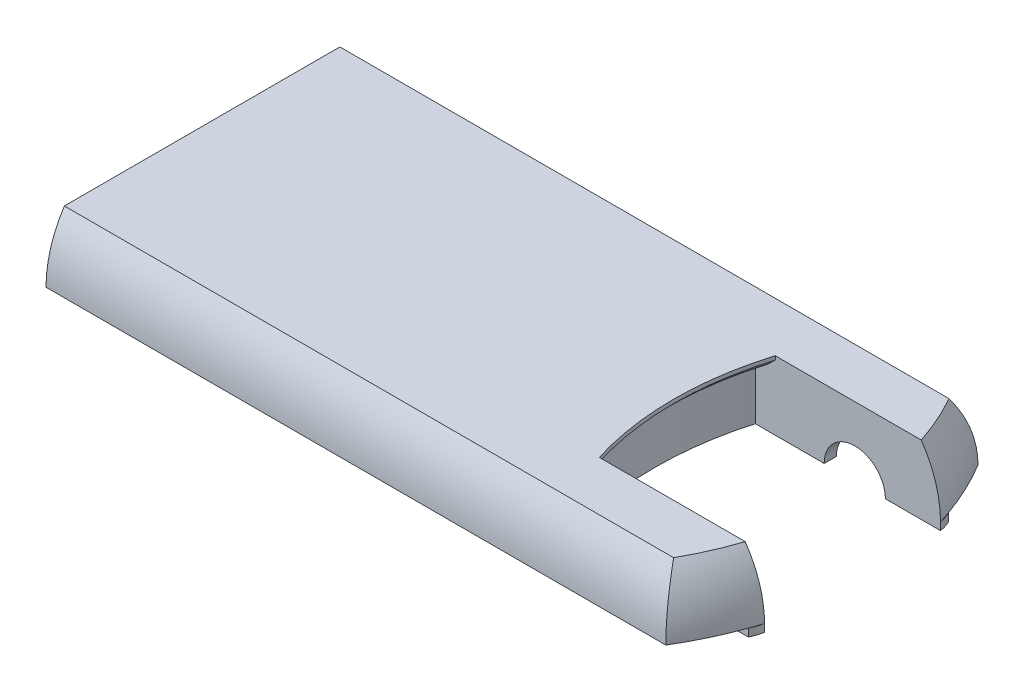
ISO-10303-21;
HEADER;
FILE_DESCRIPTION(('STEP AP214'),'2;1');
FILE_NAME('part.step','',(''),(''),'','','');
FILE_SCHEMA(('AUTOMOTIVE_DESIGN { 1 0 10303 214 1 1 1 1 }'));
ENDSEC;
DATA;
#1=APPLICATION_CONTEXT('core data for automotive mechanical design processes');
#2=APPLICATION_PROTOCOL_DEFINITION('international standard','automotive_design',2000,#1);
#3=PRODUCT_CONTEXT('',#1,'mechanical');
#4=PRODUCT('Part','Part','',(#3));
#5=PRODUCT_RELATED_PRODUCT_CATEGORY('part','',(#4));
#6=PRODUCT_DEFINITION_FORMATION('','',#4);
#7=PRODUCT_DEFINITION_CONTEXT('part definition',#1,'design');
#8=PRODUCT_DEFINITION('design','',#6,#7);
#9=PRODUCT_DEFINITION_SHAPE('','',#8);
#10=(LENGTH_UNIT() NAMED_UNIT(*) SI_UNIT(.MILLI.,.METRE.));
#11=(NAMED_UNIT(*) PLANE_ANGLE_UNIT() SI_UNIT($,.RADIAN.));
#12=(NAMED_UNIT(*) SI_UNIT($,.STERADIAN.) SOLID_ANGLE_UNIT());
#13=UNCERTAINTY_MEASURE_WITH_UNIT(LENGTH_MEASURE(1.E-05),#10,'distance_accuracy_value','');
#14=(GEOMETRIC_REPRESENTATION_CONTEXT(3) GLOBAL_UNCERTAINTY_ASSIGNED_CONTEXT((#13)) GLOBAL_UNIT_ASSIGNED_CONTEXT((#10,
#11,#12)) REPRESENTATION_CONTEXT('',''));
#15=CARTESIAN_POINT('',(0.,0.,0.));
#16=DIRECTION('',(0.,0.,1.));
#17=DIRECTION('',(1.,0.,0.));
#18=AXIS2_PLACEMENT_3D('',#15,#16,#17);
#19=CARTESIAN_POINT('',(85.,0.,-8.9));
#20=DIRECTION('',(0.,0.,1.));
#21=DIRECTION('',(1.,0.,0.));
#22=AXIS2_PLACEMENT_3D('',#19,#20,#21);
#23=PLANE('',#22);
#24=CARTESIAN_POINT('',(73.792334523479,-1.,-8.9));
#25=DIRECTION('',(0.,0.,1.));
#26=DIRECTION('',(1.,0.,0.));
#27=AXIS2_PLACEMENT_3D('',#24,#25,#26);
#28=CIRCLE('',#27,4.);
#29=CARTESIAN_POINT('',(69.792334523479,-1.,-8.90000000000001));
#30=VERTEX_POINT('',#29);
#31=CARTESIAN_POINT('',(77.792334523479,-1.,-8.90000000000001));
#32=VERTEX_POINT('',#31);
#33=EDGE_CURVE('E209',#30,#32,#28,.F.);
#34=ORIENTED_EDGE('',*,*,#33,.F.);
#35=DIRECTION('',(1.,0.,0.));
#36=VECTOR('',#35,1.);
#37=CARTESIAN_POINT('',(60.792334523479,-1.,-8.89999999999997));
#38=LINE('',#37,#36);
#39=CARTESIAN_POINT('',(60.792334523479,-1.,-8.89999999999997));
#40=VERTEX_POINT('',#39);
#41=EDGE_CURVE('E520',#40,#30,#38,.T.);
#42=ORIENTED_EDGE('',*,*,#41,.F.);
#43=DIRECTION('',(0.,-1.,0.));
#44=VECTOR('',#43,1.);
#45=CARTESIAN_POINT('',(60.792334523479,6.5,-8.89999999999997));
#46=LINE('',#45,#44);
#47=CARTESIAN_POINT('',(60.792334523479,6.5,-8.89999999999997));
#48=VERTEX_POINT('',#47);
#49=EDGE_CURVE('E462',#48,#40,#46,.T.);
#50=ORIENTED_EDGE('',*,*,#49,.F.);
#51=DIRECTION('',(-1.,0.,0.));
#52=VECTOR('',#51,1.);
#53=CARTESIAN_POINT('',(63.4,6.5,-8.9));
#54=LINE('',#53,#52);
#55=CARTESIAN_POINT('',(62.3552210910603,6.5,-8.9));
#56=VERTEX_POINT('',#55);
#57=EDGE_CURVE('E810',#56,#48,#54,.T.);
#58=ORIENTED_EDGE('',*,*,#57,.F.);
#59=CARTESIAN_POINT('',(62.3552210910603,6.5,-8.9));
#60=CARTESIAN_POINT('',(62.529254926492,6.66676694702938,-8.9));
#61=CARTESIAN_POINT('',(62.7033367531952,6.83348375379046,-8.9));
#62=CARTESIAN_POINT('',(63.0515963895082,7.16681708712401,-8.9));
#63=CARTESIAN_POINT('',(63.2257741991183,7.33343361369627,-8.9));
#64=CARTESIAN_POINT('',(63.4,7.50000000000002,-8.9));
#65=B_SPLINE_CURVE_WITH_KNOTS('',3,(#59,#60,#61,#62,#63,#64),.UNSPECIFIED.,.F.,.F.,(4,2,4),(0.,
0.723111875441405,1.44622375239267),.UNSPECIFIED.);
#66=CARTESIAN_POINT('',(63.4,7.50000000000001,-8.9));
#67=VERTEX_POINT('',#66);
#68=EDGE_CURVE('E349',#56,#67,#65,.T.);
#69=ORIENTED_EDGE('',*,*,#68,.T.);
#70=DIRECTION('',(0.,1.,0.));
#71=VECTOR('',#70,1.);
#72=CARTESIAN_POINT('',(63.4,0.,-8.9));
#73=LINE('',#72,#71);
#74=CARTESIAN_POINT('',(63.4,8.,-8.9));
#75=VERTEX_POINT('',#74);
#76=EDGE_CURVE('E386',#67,#75,#73,.T.);
#77=ORIENTED_EDGE('',*,*,#76,.T.);
#78=DIRECTION('',(1.,0.,0.));
#79=VECTOR('',#78,1.);
#80=CARTESIAN_POINT('',(85.,8.,-8.9));
#81=LINE('',#80,#79);
#82=CARTESIAN_POINT('',(82.4775006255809,8.,-8.9));
#83=VERTEX_POINT('',#82);
#84=EDGE_CURVE('E417',#75,#83,#81,.T.);
#85=ORIENTED_EDGE('',*,*,#84,.T.);
#86=CARTESIAN_POINT('',(80.5834136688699,10.2138014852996,-8.9));
#87=CARTESIAN_POINT('',(80.8734949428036,9.93645044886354,-8.9));
#88=CARTESIAN_POINT('',(81.1522302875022,9.64721683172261,-8.9));
#89=CARTESIAN_POINT('',(81.6848296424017,9.04667786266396,-8.9));
#90=CARTESIAN_POINT('',(81.9386934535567,8.73537233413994,-8.9));
#91=CARTESIAN_POINT('',(82.4195732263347,8.09255852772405,-8.9));
#92=CARTESIAN_POINT('',(82.6465835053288,7.76104599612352,-8.9));
#93=CARTESIAN_POINT('',(83.0718390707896,7.08005065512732,-8.9));
#94=CARTESIAN_POINT('',(83.2700844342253,6.73056789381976,-8.9));
#95=CARTESIAN_POINT('',(83.6363686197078,6.01561157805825,-8.9));
#96=CARTESIAN_POINT('',(83.8043732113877,5.6501204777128,-8.9));
#97=CARTESIAN_POINT('',(84.108480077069,4.90609075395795,-8.9));
#98=CARTESIAN_POINT('',(84.2445821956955,4.52755206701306,-8.9));
#99=CARTESIAN_POINT('',(84.4837097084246,3.76018934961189,-8.9));
#100=CARTESIAN_POINT('',(84.5867371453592,3.37136595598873,-8.9));
#101=CARTESIAN_POINT('',(84.7588345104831,2.5862765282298,-8.9));
#102=CARTESIAN_POINT('',(84.8279049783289,2.19001061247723,-8.9));
#103=CARTESIAN_POINT('',(84.9304846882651,1.40072451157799,-8.9));
#104=CARTESIAN_POINT('',(84.964657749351,1.00779047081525,-8.9));
#105=CARTESIAN_POINT('',(84.9994899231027,0.220442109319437,-8.9));
#106=CARTESIAN_POINT('',(85.0001494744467,-0.173972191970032,-8.9));
#107=CARTESIAN_POINT('',(84.967950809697,-0.961400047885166,-8.9));
#108=CARTESIAN_POINT('',(84.9350950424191,-1.35441370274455,-8.9));
#109=CARTESIAN_POINT('',(84.83614547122,-2.13623296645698,-8.9));
#110=CARTESIAN_POINT('',(84.7700517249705,-2.52503858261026,-8.9));
#111=CARTESIAN_POINT('',(84.6058472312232,-3.29253584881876,-8.9));
#112=CARTESIAN_POINT('',(84.5079996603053,-3.67128385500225,-8.9));
#113=CARTESIAN_POINT('',(84.2809488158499,-4.41925501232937,-8.9));
#114=CARTESIAN_POINT('',(84.1517458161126,-4.7884782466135,-8.9));
#115=CARTESIAN_POINT('',(83.8630294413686,-5.51487847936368,-8.9));
#116=CARTESIAN_POINT('',(83.7035156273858,-5.87205530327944,-8.9));
#117=CARTESIAN_POINT('',(83.3554567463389,-6.57196895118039,-8.9));
#118=CARTESIAN_POINT('',(83.1669113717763,-6.9147056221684,-8.9));
#119=CARTESIAN_POINT('',(82.7600513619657,-7.58719131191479,-8.9));
#120=CARTESIAN_POINT('',(82.5414320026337,-7.91675593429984,-8.9));
#121=CARTESIAN_POINT('',(82.077778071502,-8.55673734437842,-8.9));
#122=CARTESIAN_POINT('',(81.8327434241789,-8.86715407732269,-8.9));
#123=CARTESIAN_POINT('',(81.3181674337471,-9.4669434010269,-8.9));
#124=CARTESIAN_POINT('',(81.0486264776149,-9.75631632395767,-8.9));
#125=CARTESIAN_POINT('',(80.4870786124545,-10.3123659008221,-8.9));
#126=CARTESIAN_POINT('',(80.1950712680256,-10.5790421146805,-8.9));
#127=CARTESIAN_POINT('',(79.5813344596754,-11.0962094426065,-8.9));
#128=CARTESIAN_POINT('',(79.258962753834,-11.3459383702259,-8.9));
#129=CARTESIAN_POINT('',(78.5950764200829,-11.8184822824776,-8.9));
#130=CARTESIAN_POINT('',(78.2535614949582,-12.0412968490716,-8.9));
#131=CARTESIAN_POINT('',(77.553794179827,-12.4590891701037,-8.9));
#132=CARTESIAN_POINT('',(77.1955371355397,-12.6540591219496,-8.9));
#133=CARTESIAN_POINT('',(76.4648908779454,-13.0154005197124,-8.9));
#134=CARTESIAN_POINT('',(76.0925012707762,-13.1817711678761,-8.9));
#135=CARTESIAN_POINT('',(75.3147870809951,-13.4940579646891,-8.9));
#136=CARTESIAN_POINT('',(74.9087884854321,-13.6382957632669,-8.9));
#137=CARTESIAN_POINT('',(74.0866861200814,-13.8942627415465,-8.9));
#138=CARTESIAN_POINT('',(73.6705820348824,-14.0059909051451,-8.9));
#139=CARTESIAN_POINT('',(72.8311317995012,-14.1971024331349,-8.9));
#140=CARTESIAN_POINT('',(72.407787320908,-14.2764931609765,-8.9));
#141=CARTESIAN_POINT('',(71.5563400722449,-14.4034670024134,-8.9));
#142=CARTESIAN_POINT('',(71.1282367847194,-14.4510466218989,-8.9));
#143=CARTESIAN_POINT('',(70.2300067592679,-14.5181235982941,-8.9));
#144=CARTESIAN_POINT('',(69.7596555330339,-14.5346165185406,-8.9));
#145=CARTESIAN_POINT('',(68.819077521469,-14.5318942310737,-8.9));
#146=CARTESIAN_POINT('',(68.3488507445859,-14.5126770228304,-8.9));
#147=CARTESIAN_POINT('',(67.4110132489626,-14.4402036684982,-8.9));
#148=CARTESIAN_POINT('',(66.9434028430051,-14.3869435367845,-8.9));
#149=CARTESIAN_POINT('',(66.0128957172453,-14.2483051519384,-8.9));
#150=CARTESIAN_POINT('',(65.54999998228,-14.1629203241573,-8.9));
#151=CARTESIAN_POINT('',(64.7360053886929,-13.9851944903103,-8.9));
#152=CARTESIAN_POINT('',(64.383562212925,-13.8989160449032,-8.9));
#153=CARTESIAN_POINT('',(63.6831607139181,-13.709627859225,-8.9));
#154=CARTESIAN_POINT('',(63.3352028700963,-13.6066163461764,-8.9));
#155=CARTESIAN_POINT('',(62.6440596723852,-13.3849302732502,-8.9));
#156=CARTESIAN_POINT('',(62.3008778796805,-13.2662446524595,-8.9));
#157=CARTESIAN_POINT('',(61.6198393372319,-13.014458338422,-8.9));
#158=CARTESIAN_POINT('',(61.2819828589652,-12.8813569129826,-8.9));
#159=CARTESIAN_POINT('',(60.6089029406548,-12.6008037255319,-8.9));
#160=CARTESIAN_POINT('',(60.2737267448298,-12.4532389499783,-8.9));
#161=CARTESIAN_POINT('',(59.6089722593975,-12.1460891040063,-8.9));
#162=CARTESIAN_POINT('',(59.2793936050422,-11.9865048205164,-8.9));
#163=CARTESIAN_POINT('',(58.6261665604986,-11.6570205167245,-8.9));
#164=CARTESIAN_POINT('',(58.3025088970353,-11.4871388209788,-8.9));
#165=CARTESIAN_POINT('',(57.6601239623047,-11.1383374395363,-8.9));
#166=CARTESIAN_POINT('',(57.3413966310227,-10.9594178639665,-8.9));
#167=CARTESIAN_POINT('',(56.6814413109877,-10.5787655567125,-8.9));
#168=CARTESIAN_POINT('',(56.340589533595,-10.3763830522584,-8.9));
#169=CARTESIAN_POINT('',(55.6626604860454,-9.96534981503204,-8.9));
#170=CARTESIAN_POINT('',(55.3255836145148,-9.75669842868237,-8.9));
#171=CARTESIAN_POINT('',(54.6513309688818,-9.33470794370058,-8.9));
#172=CARTESIAN_POINT('',(54.314168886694,-9.12134714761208,-8.9));
#173=CARTESIAN_POINT('',(53.6396536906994,-8.69514369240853,-8.9));
#174=CARTESIAN_POINT('',(53.302300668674,-8.4823008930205,-8.9));
#175=CARTESIAN_POINT('',(52.7982656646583,-8.17038229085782,-8.9));
#176=CARTESIAN_POINT('',(52.6329815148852,-8.06905974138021,-8.9));
#177=CARTESIAN_POINT('',(52.3010569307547,-7.86866629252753,-8.9));
#178=CARTESIAN_POINT('',(52.1344165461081,-7.76959531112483,-8.9));
#179=CARTESIAN_POINT('',(51.7989444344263,-7.57456196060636,-8.9));
#180=CARTESIAN_POINT('',(51.6301095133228,-7.47860505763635,-8.9));
#181=CARTESIAN_POINT('',(51.2899164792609,-7.29129056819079,-8.9));
#182=CARTESIAN_POINT('',(51.1185586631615,-7.19993244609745,-8.9));
#183=CARTESIAN_POINT('',(50.7746713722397,-7.02449874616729,-8.9));
#184=CARTESIAN_POINT('',(50.6021795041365,-6.94035003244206,-8.9));
#185=CARTESIAN_POINT('',(50.2533951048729,-6.78015370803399,-8.9));
#186=CARTESIAN_POINT('',(50.0771018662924,-6.70410762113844,-8.9));
#187=CARTESIAN_POINT('',(49.7208303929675,-6.56286407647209,-8.9));
#188=CARTESIAN_POINT('',(49.5408659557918,-6.49763225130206,-8.9));
#189=CARTESIAN_POINT('',(49.1766519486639,-6.38067205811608,-8.9));
#190=CARTESIAN_POINT('',(48.9924054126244,-6.32893442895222,-8.9));
#191=CARTESIAN_POINT('',(48.6493626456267,-6.24883362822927,-8.9));
#192=CARTESIAN_POINT('',(48.4911318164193,-6.21807166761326,-8.9));
#193=CARTESIAN_POINT('',(48.1724524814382,-6.16985686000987,-8.9));
#194=CARTESIAN_POINT('',(48.0120018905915,-6.15241753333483,-8.9));
#195=CARTESIAN_POINT('',(47.6908508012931,-6.13200282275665,-8.9));
#196=CARTESIAN_POINT('',(47.5301542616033,-6.1289662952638,-8.9));
#197=CARTESIAN_POINT('',(47.2090845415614,-6.13737980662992,-8.9));
#198=CARTESIAN_POINT('',(47.0487115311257,-6.1488361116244,-8.9));
#199=CARTESIAN_POINT('',(46.6929216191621,-6.18977095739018,-8.9));
#200=CARTESIAN_POINT('',(46.4979119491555,-6.22278316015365,-8.9));
#201=CARTESIAN_POINT('',(46.1119093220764,-6.30697310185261,-8.9));
#202=CARTESIAN_POINT('',(45.9209171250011,-6.35815424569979,-8.9));
#203=CARTESIAN_POINT('',(45.6370215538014,-6.44628902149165,-8.9));
#204=CARTESIAN_POINT('',(45.5423554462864,-6.47774726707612,-8.9));
#205=CARTESIAN_POINT('',(45.3542319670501,-6.54399786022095,-8.9));
#206=CARTESIAN_POINT('',(45.2607741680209,-6.57878899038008,-8.9));
#207=CARTESIAN_POINT('',(45.0750312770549,-6.6513016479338,-8.9));
#208=CARTESIAN_POINT('',(44.9827459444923,-6.6890225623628,-8.9));
#209=CARTESIAN_POINT('',(44.7992680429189,-6.76703211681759,-8.9));
#210=CARTESIAN_POINT('',(44.7080755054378,-6.80732083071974,-8.9));
#211=CARTESIAN_POINT('',(44.4270300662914,-6.93562935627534,-8.9));
#212=CARTESIAN_POINT('',(44.2389051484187,-7.02743956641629,-8.9));
#213=CARTESIAN_POINT('',(43.8663109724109,-7.21823201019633,-8.9));
#214=CARTESIAN_POINT('',(43.6818428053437,-7.31721634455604,-8.9));
#215=CARTESIAN_POINT('',(43.3155810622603,-7.52041423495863,-8.9));
#216=CARTESIAN_POINT('',(43.1337903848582,-7.62463298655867,-8.9));
#217=CARTESIAN_POINT('',(42.7723262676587,-7.8366162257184,-8.9));
#218=CARTESIAN_POINT('',(42.5926526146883,-7.94438035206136,-8.9));
#219=CARTESIAN_POINT('',(42.2341292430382,-8.16259260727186,-8.9));
#220=CARTESIAN_POINT('',(42.0552842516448,-8.27304847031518,-8.9));
#221=CARTESIAN_POINT('',(41.6984367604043,-8.49531527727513,-8.9));
#222=CARTESIAN_POINT('',(41.5204342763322,-8.60712624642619,-8.9));
#223=CARTESIAN_POINT('',(40.9871264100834,-8.94322177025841,-8.9));
#224=CARTESIAN_POINT('',(40.6323195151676,-9.16829401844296,-8.9));
#225=CARTESIAN_POINT('',(39.9211621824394,-9.6154490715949,-8.9));
#226=CARTESIAN_POINT('',(39.5648130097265,-9.83753387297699,-8.9));
#227=CARTESIAN_POINT('',(38.8480994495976,-10.2752807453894,-8.9));
#228=CARTESIAN_POINT('',(38.4877345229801,-10.4909419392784,-8.9));
#229=CARTESIAN_POINT('',(37.7621114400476,-10.9124904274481,-8.9));
#230=CARTESIAN_POINT('',(37.3968625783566,-11.1183936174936,-8.9));
#231=CARTESIAN_POINT('',(36.6599149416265,-11.5182583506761,-8.9));
#232=CARTESIAN_POINT('',(36.2882166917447,-11.7122208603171,-8.9));
#233=CARTESIAN_POINT('',(35.3278211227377,-12.190433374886,-8.9));
#234=CARTESIAN_POINT('',(34.7339902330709,-12.4645315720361,-8.9));
#235=CARTESIAN_POINT('',(33.52813335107,-12.9703708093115,-8.9));
#236=CARTESIAN_POINT('',(32.9161004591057,-13.2020955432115,-8.9));
#237=CARTESIAN_POINT('',(31.6742226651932,-13.6162210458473,-8.9));
#238=CARTESIAN_POINT('',(31.0443484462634,-13.7985347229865,-8.9));
#239=CARTESIAN_POINT('',(29.7709155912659,-14.106580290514,-8.9));
#240=CARTESIAN_POINT('',(29.1273615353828,-14.2323308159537,-8.9));
#241=CARTESIAN_POINT('',(27.9774946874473,-14.4000292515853,-8.9));
#242=CARTESIAN_POINT('',(27.4729916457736,-14.4544859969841,-8.9));
#243=CARTESIAN_POINT('',(26.4612381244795,-14.523572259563,-8.9));
#244=CARTESIAN_POINT('',(25.9539879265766,-14.5382057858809,-8.9));
#245=CARTESIAN_POINT('',(24.9406682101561,-14.5256175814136,-8.9));
#246=CARTESIAN_POINT('',(24.434598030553,-14.4984540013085,-8.9));
#247=CARTESIAN_POINT('',(23.4265956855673,-14.4007896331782,-8.9));
#248=CARTESIAN_POINT('',(22.9246636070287,-14.3302879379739,-8.9));
#249=CARTESIAN_POINT('',(21.9255746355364,-14.1442121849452,-8.9));
#250=CARTESIAN_POINT('',(21.4284749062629,-14.0283292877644,-8.9));
#251=CARTESIAN_POINT('',(20.4470969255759,-13.7509743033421,-8.9));
#252=CARTESIAN_POINT('',(19.9628190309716,-13.5895009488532,-8.9));
#253=CARTESIAN_POINT('',(19.0117253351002,-13.2210198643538,-8.9));
#254=CARTESIAN_POINT('',(18.5449140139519,-13.0140005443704,-8.9));
#255=CARTESIAN_POINT('',(17.6338178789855,-12.5552343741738,-8.9));
#256=CARTESIAN_POINT('',(17.1895301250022,-12.3034933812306,-8.9));
#257=CARTESIAN_POINT('',(16.3766419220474,-11.7874110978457,-8.9));
#258=CARTESIAN_POINT('',(16.0051364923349,-11.5276355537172,-8.9));
#259=CARTESIAN_POINT('',(15.2871726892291,-10.975506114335,-8.9));
#260=CARTESIAN_POINT('',(14.940712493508,-10.6831545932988,-8.9));
#261=CARTESIAN_POINT('',(14.2763430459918,-10.0680034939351,-8.9));
#262=CARTESIAN_POINT('',(13.9584166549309,-9.74522243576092,-8.9));
#263=CARTESIAN_POINT('',(13.3540212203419,-9.0714369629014,-8.9));
#264=CARTESIAN_POINT('',(13.0675503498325,-8.72043418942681,-8.9));
#265=CARTESIAN_POINT('',(12.5506545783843,-8.02228556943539,-8.9));
#266=CARTESIAN_POINT('',(12.3175746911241,-7.67710217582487,-8.9));
#267=CARTESIAN_POINT('',(11.8825090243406,-6.96767281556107,-8.9));
#268=CARTESIAN_POINT('',(11.680521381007,-6.6034279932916,-8.9));
#269=CARTESIAN_POINT('',(11.3094760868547,-5.85861766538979,-8.9));
#270=CARTESIAN_POINT('',(11.1404122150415,-5.47805525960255,-8.9));
#271=CARTESIAN_POINT('',(10.8367024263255,-4.70343171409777,-8.9));
#272=CARTESIAN_POINT('',(10.7020558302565,-4.3093708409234,-8.9));
#273=CARTESIAN_POINT('',(10.4733765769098,-3.52777419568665,-8.9));
#274=CARTESIAN_POINT('',(10.3778630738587,-3.14067099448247,-8.9));
#275=CARTESIAN_POINT('',(10.220337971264,-2.35971251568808,-8.9));
#276=CARTESIAN_POINT('',(10.1583252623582,-1.9658574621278,-8.9));
#277=CARTESIAN_POINT('',(10.0683352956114,-1.17432358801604,-8.9));
#278=CARTESIAN_POINT('',(10.0403541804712,-0.776645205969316,-8.9));
#279=CARTESIAN_POINT('',(10.0186546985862,0.0196462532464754,-8.9));
#280=CARTESIAN_POINT('',(10.0249361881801,0.418259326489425,-8.9));
#281=CARTESIAN_POINT('',(10.0712984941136,1.20653269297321,-8.9));
#282=CARTESIAN_POINT('',(10.1107880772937,1.59622790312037,-8.9));
#283=CARTESIAN_POINT('',(10.2224633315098,2.37089880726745,-8.9));
#284=CARTESIAN_POINT('',(10.2946484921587,2.75587457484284,-8.9));
#285=CARTESIAN_POINT('',(10.4711168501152,3.51838208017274,-8.9));
#286=CARTESIAN_POINT('',(10.5753990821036,3.89591404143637,-8.9));
#287=CARTESIAN_POINT('',(10.815208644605,4.64091883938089,-8.9));
#288=CARTESIAN_POINT('',(10.9507361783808,5.00839161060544,-8.9));
#289=CARTESIAN_POINT('',(11.2523034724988,5.73164239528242,-8.9));
#290=CARTESIAN_POINT('',(11.4184167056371,6.08738976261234,-8.9));
#291=CARTESIAN_POINT('',(11.7795967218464,6.7838610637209,-8.9));
#292=CARTESIAN_POINT('',(11.9746634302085,7.12458503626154,-8.9));
#293=CARTESIAN_POINT('',(12.3922070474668,7.78880215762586,-8.9));
#294=CARTESIAN_POINT('',(12.6146844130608,8.11229501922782,-8.9));
#295=CARTESIAN_POINT('',(13.0853146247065,8.74002566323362,-8.9));
#296=CARTESIAN_POINT('',(13.3334678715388,9.04426314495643,-8.9));
#297=CARTESIAN_POINT('',(13.8592145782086,9.6380611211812,-8.9));
#298=CARTESIAN_POINT('',(14.1373307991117,9.92715872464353,-8.9));
#299=CARTESIAN_POINT('',(14.7162301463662,10.4816759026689,-8.9));
#300=CARTESIAN_POINT('',(15.0170134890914,10.7470952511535,-8.9));
#301=CARTESIAN_POINT('',(15.6390133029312,11.2528631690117,-8.9));
#302=CARTESIAN_POINT('',(15.9602321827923,11.4932087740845,-8.9));
#303=CARTESIAN_POINT('',(16.6207262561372,11.9476424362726,-8.9));
#304=CARTESIAN_POINT('',(16.9600018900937,12.1617298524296,-8.9));
#305=CARTESIAN_POINT('',(17.6695432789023,12.5716127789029,-8.9));
#306=CARTESIAN_POINT('',(18.0405158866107,12.7661847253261,-8.9));
#307=CARTESIAN_POINT('',(18.7968136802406,13.1250480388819,-8.9));
#308=CARTESIAN_POINT('',(19.1821391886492,13.2893387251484,-8.9));
#309=CARTESIAN_POINT('',(19.9644235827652,13.5872595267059,-8.9));
#310=CARTESIAN_POINT('',(20.3613818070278,13.7208913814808,-8.9));
#311=CARTESIAN_POINT('',(21.1643574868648,13.9574518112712,-8.9));
#312=CARTESIAN_POINT('',(21.5703758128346,14.0603774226,-8.9));
#313=CARTESIAN_POINT('',(22.4191622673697,14.2422091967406,-8.9));
#314=CARTESIAN_POINT('',(22.8624305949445,14.3187811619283,-8.9));
#315=CARTESIAN_POINT('',(23.753534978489,14.4373804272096,-8.9));
#316=CARTESIAN_POINT('',(24.2013711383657,14.4794069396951,-8.9));
#317=CARTESIAN_POINT('',(25.0992287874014,14.5298846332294,-8.9));
#318=CARTESIAN_POINT('',(25.5492516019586,14.5383119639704,-8.9));
#319=CARTESIAN_POINT('',(26.4487535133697,14.5227810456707,-8.9));
#320=CARTESIAN_POINT('',(26.8982325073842,14.4988174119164,-8.9));
#321=CARTESIAN_POINT('',(27.9668984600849,14.4048078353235,-8.9));
#322=CARTESIAN_POINT('',(28.5848692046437,14.3205832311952,-8.9));
#323=CARTESIAN_POINT('',(29.8108782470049,14.0975174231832,-8.9));
#324=CARTESIAN_POINT('',(30.4189133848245,13.95865918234,-8.9));
#325=CARTESIAN_POINT('',(31.6213073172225,13.6317381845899,-8.9));
#326=CARTESIAN_POINT('',(32.2156697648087,13.4436887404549,-8.9));
#327=CARTESIAN_POINT('',(33.3887468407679,13.0242397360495,-8.9));
#328=CARTESIAN_POINT('',(33.967462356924,12.7928426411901,-8.9));
#329=CARTESIAN_POINT('',(34.8790303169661,12.393632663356,-8.9));
#330=CARTESIAN_POINT('',(35.2171614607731,12.2376734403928,-8.9));
#331=CARTESIAN_POINT('',(35.8877547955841,11.9140051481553,-8.9));
#332=CARTESIAN_POINT('',(36.2202169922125,11.7462960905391,-8.9));
#333=CARTESIAN_POINT('',(36.8798215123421,11.4006586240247,-8.9));
#334=CARTESIAN_POINT('',(37.206963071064,11.2227287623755,-8.9));
#335=CARTESIAN_POINT('',(37.8564458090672,10.8583542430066,-8.9));
#336=CARTESIAN_POINT('',(38.1787870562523,10.6719097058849,-8.9));
#337=CARTESIAN_POINT('',(38.8199561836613,10.2921207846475,-8.9));
#338=CARTESIAN_POINT('',(39.1387786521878,10.0987673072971,-8.9));
#339=CARTESIAN_POINT('',(39.773664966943,9.70757960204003,-8.9));
#340=CARTESIAN_POINT('',(40.0897287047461,9.5097451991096,-8.9));
#341=CARTESIAN_POINT('',(40.7206589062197,9.11231573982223,-8.9));
#342=CARTESIAN_POINT('',(41.0355255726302,8.91272100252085,-8.9));
#343=CARTESIAN_POINT('',(41.6662999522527,8.51519942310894,-8.9));
#344=CARTESIAN_POINT('',(41.9822076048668,8.31727248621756,-8.9));
#345=CARTESIAN_POINT('',(42.5173214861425,7.98965975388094,-8.9));
#346=CARTESIAN_POINT('',(42.7354482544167,7.85822467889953,-8.9));
#347=CARTESIAN_POINT('',(43.1748316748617,7.60058318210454,-8.9));
#348=CARTESIAN_POINT('',(43.3960888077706,7.47437757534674,-8.9));
#349=CARTESIAN_POINT('',(43.8433075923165,7.23001266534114,-8.9));
#350=CARTESIAN_POINT('',(44.0692728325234,7.11185981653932,-8.9));
#351=CARTESIAN_POINT('',(44.5270919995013,6.88777119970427,-8.9));
#352=CARTESIAN_POINT('',(44.7589441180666,6.78183173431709,-8.9));
#353=CARTESIAN_POINT('',(45.3267884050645,6.54762318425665,-8.9));
#354=CARTESIAN_POINT('',(45.6665847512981,6.42794644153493,-8.9));
#355=CARTESIAN_POINT('',(46.1862748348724,6.28952091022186,-8.9));
#356=CARTESIAN_POINT('',(46.3606964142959,6.25027735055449,-8.9));
#357=CARTESIAN_POINT('',(46.7124016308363,6.18762746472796,-8.9));
#358=CARTESIAN_POINT('',(46.8896847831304,6.16421848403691,-8.9));
#359=CARTESIAN_POINT('',(47.2479421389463,6.13474129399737,-8.9));
#360=CARTESIAN_POINT('',(47.4289348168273,6.1288926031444,-8.9));
#361=CARTESIAN_POINT('',(47.7905831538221,6.13563115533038,-8.9));
#362=CARTESIAN_POINT('',(47.9712387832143,6.1482199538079,-8.9));
#363=CARTESIAN_POINT('',(48.3312060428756,6.19093097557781,-8.9));
#364=CARTESIAN_POINT('',(48.5105085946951,6.22112811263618,-8.9));
#365=CARTESIAN_POINT('',(48.8656790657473,6.29697366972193,-8.9));
#366=CARTESIAN_POINT('',(49.0415480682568,6.34261713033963,-8.9));
#367=CARTESIAN_POINT('',(49.502986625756,6.48075815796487,-8.9));
#368=CARTESIAN_POINT('',(49.7851973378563,6.58438854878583,-8.9));
#369=CARTESIAN_POINT('',(50.3397532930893,6.81563931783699,-8.9));
#370=CARTESIAN_POINT('',(50.6120808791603,6.94330033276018,-8.9));
#371=CARTESIAN_POINT('',(51.150384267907,7.21479016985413,-8.9));
#372=CARTESIAN_POINT('',(51.4163146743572,7.35870753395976,-8.9));
#373=CARTESIAN_POINT('',(51.9425207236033,7.65601607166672,-8.9));
#374=CARTESIAN_POINT('',(52.2027998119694,7.8094012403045,-8.9));
#375=CARTESIAN_POINT('',(52.7246722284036,8.12436080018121,-8.9));
#376=CARTESIAN_POINT('',(52.9862063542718,8.28603240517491,-8.9));
#377=CARTESIAN_POINT('',(53.5077380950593,8.61188054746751,-8.9));
#378=CARTESIAN_POINT('',(53.7677355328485,8.77605736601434,-8.9));
#379=CARTESIAN_POINT('',(54.2867847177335,9.10406261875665,-8.9));
#380=CARTESIAN_POINT('',(54.5458368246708,9.26789048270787,-8.9));
#381=CARTESIAN_POINT('',(55.0649430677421,9.59394138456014,-8.9));
#382=CARTESIAN_POINT('',(55.3249971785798,9.75616446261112,-8.9));
#383=CARTESIAN_POINT('',(55.9321938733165,10.1300072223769,-8.9));
#384=CARTESIAN_POINT('',(56.2800557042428,10.3404664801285,-8.9));
#385=CARTESIAN_POINT('',(56.9806327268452,10.7531897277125,-8.9));
#386=CARTESIAN_POINT('',(57.333347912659,10.955453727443,-8.9));
#387=CARTESIAN_POINT('',(58.0450287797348,11.3495986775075,-8.9));
#388=CARTESIAN_POINT('',(58.4040004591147,11.5414688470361,-8.9));
#389=CARTESIAN_POINT('',(59.1284771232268,11.9124446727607,-8.9));
#390=CARTESIAN_POINT('',(59.4939816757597,12.0915511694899,-8.9));
#391=CARTESIAN_POINT('',(60.2287603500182,12.4335877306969,-8.9));
#392=CARTESIAN_POINT('',(60.5979766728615,12.5966414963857,-8.9));
#393=CARTESIAN_POINT('',(61.3431854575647,12.9064495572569,-8.9));
#394=CARTESIAN_POINT('',(61.7191775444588,13.0532047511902,-8.9));
#395=CARTESIAN_POINT('',(62.4775052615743,13.3286282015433,-8.9));
#396=CARTESIAN_POINT('',(62.8598370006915,13.4573071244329,-8.9));
#397=CARTESIAN_POINT('',(63.6305481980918,13.6950474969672,-8.9));
#398=CARTESIAN_POINT('',(64.0189275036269,13.8041094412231,-8.9));
#399=CARTESIAN_POINT('',(64.9190704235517,14.0308002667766,-8.9));
#400=CARTESIAN_POINT('',(65.4327121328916,14.1410889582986,-8.9));
#401=CARTESIAN_POINT('',(66.4667407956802,14.3226325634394,-8.9));
#402=CARTESIAN_POINT('',(66.9871257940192,14.3938985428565,-8.9));
#403=CARTESIAN_POINT('',(68.0325933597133,14.4946982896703,-8.9));
#404=CARTESIAN_POINT('',(68.5576806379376,14.5241840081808,-8.9));
#405=CARTESIAN_POINT('',(69.6085354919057,14.5388486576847,-8.9));
#406=CARTESIAN_POINT('',(70.1343030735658,14.5240272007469,-8.9));
#407=CARTESIAN_POINT('',(71.1864458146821,14.4478593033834,-8.9));
#408=CARTESIAN_POINT('',(71.7127964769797,14.3861680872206,-8.9));
#409=CARTESIAN_POINT('',(72.7576496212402,14.2144401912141,-8.9));
#410=CARTESIAN_POINT('',(73.276151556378,14.1044001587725,-8.9));
#411=CARTESIAN_POINT('',(74.2998195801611,13.8353612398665,-8.9));
#412=CARTESIAN_POINT('',(74.8049976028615,13.6764079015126,-8.9));
#413=CARTESIAN_POINT('',(75.7971772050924,13.3095005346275,-8.9));
#414=CARTESIAN_POINT('',(76.2841842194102,13.1015612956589,-8.9));
#415=CARTESIAN_POINT('',(77.1095113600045,12.6985806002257,-8.9));
#416=CARTESIAN_POINT('',(77.4532437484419,12.5145359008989,-8.9));
#417=CARTESIAN_POINT('',(78.1257195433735,12.1208744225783,-8.9));
#418=CARTESIAN_POINT('',(78.4544651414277,11.9112613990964,-8.9));
#419=CARTESIAN_POINT('',(79.0946544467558,11.4673740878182,-8.9));
#420=CARTESIAN_POINT('',(79.4061057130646,11.2331107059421,-8.9));
#421=CARTESIAN_POINT('',(80.0097381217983,10.7408962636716,-8.9));
#422=CARTESIAN_POINT('',(80.3019180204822,10.482943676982,-8.9));
#423=CARTESIAN_POINT('',(80.5834136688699,10.2138014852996,-8.9));
#424=B_SPLINE_CURVE_WITH_KNOTS('',3,(#86,#87,#88,#89,#90,#91,#92,#93,#94,#95,#96,#97,#98,#99,
#100,#101,#102,#103,#104,#105,#106,#107,#108,#109,#110,#111,#112,#113,#114,#115,#116,#117,#118,
#119,#120,#121,#122,#123,#124,#125,#126,#127,#128,#129,#130,#131,#132,#133,#134,#135,#136,#137,
#138,#139,#140,#141,#142,#143,#144,#145,#146,#147,#148,#149,#150,#151,#152,#153,#154,#155,#156,
#157,#158,#159,#160,#161,#162,#163,#164,#165,#166,#167,#168,#169,#170,#171,#172,#173,#174,#175,
#176,#177,#178,#179,#180,#181,#182,#183,#184,#185,#186,#187,#188,#189,#190,#191,#192,#193,#194,
#195,#196,#197,#198,#199,#200,#201,#202,#203,#204,#205,#206,#207,#208,#209,#210,#211,#212,#213,
#214,#215,#216,#217,#218,#219,#220,#221,#222,#223,#224,#225,#226,#227,#228,#229,#230,#231,#232,
#233,#234,#235,#236,#237,#238,#239,#240,#241,#242,#243,#244,#245,#246,#247,#248,#249,#250,#251,
#252,#253,#254,#255,#256,#257,#258,#259,#260,#261,#262,#263,#264,#265,#266,#267,#268,#269,#270,
#271,#272,#273,#274,#275,#276,#277,#278,#279,#280,#281,#282,#283,#284,#285,#286,#287,#288,#289,
#290,#291,#292,#293,#294,#295,#296,#297,#298,#299,#300,#301,#302,#303,#304,#305,#306,#307,#308,
#309,#310,#311,#312,#313,#314,#315,#316,#317,#318,#319,#320,#321,#322,#323,#324,#325,#326,#327,
#328,#329,#330,#331,#332,#333,#334,#335,#336,#337,#338,#339,#340,#341,#342,#343,#344,#345,#346,
#347,#348,#349,#350,#351,#352,#353,#354,#355,#356,#357,#358,#359,#360,#361,#362,#363,#364,#365,
#366,#367,#368,#369,#370,#371,#372,#373,#374,#375,#376,#377,#378,#379,#380,#381,#382,#383,#384,
#385,#386,#387,#388,#389,#390,#391,#392,#393,#394,#395,#396,#397,#398,#399,#400,#401,#402,#403,
#404,#405,#406,#407,#408,#409,#410,#411,#412,#413,#414,#415,#416,#417,#418,#419,#420,#421,#422,
#423),.UNSPECIFIED.,.T.,.F.,(4,2,2,2,2,2,2,2,2,2,2,2,2,2,2,2,2,2,2,2,2,2,2,2,2,2,2,2,2,2,2,2,2,
2,2,2,2,2,2,2,2,2,2,2,2,2,2,2,2,2,2,2,2,2,2,2,2,2,2,2,2,2,2,2,2,2,2,2,2,2,2,2,2,2,2,2,2,2,2,2,2,
2,2,2,2,2,2,2,2,2,2,2,2,2,2,2,2,2,2,2,2,2,2,2,2,2,2,2,2,2,2,2,2,2,2,2,2,2,2,2,2,2,2,2,2,2,2,2,2,
2,2,2,2,2,2,2,2,2,2,2,2,2,2,2,2,2,2,2,2,2,2,2,2,2,2,2,2,2,2,2,2,2,2,2,2,2,2,2,4),(0.,
1.20368245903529,2.40737455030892,3.61132090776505,4.81526404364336,6.02056150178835,
7.22586482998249,8.43109369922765,9.63630341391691,10.8181347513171,11.9999506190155,
13.1816801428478,14.3634076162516,15.5355808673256,16.7077438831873,17.8799238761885,
19.0521162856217,20.237206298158,21.4222996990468,22.607374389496,23.792472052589,
25.014458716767,26.2364643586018,27.4588117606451,28.6811932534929,29.9723766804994,
31.2636004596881,32.5545300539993,33.8456014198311,35.256087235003,36.6666520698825,
38.0773820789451,39.4884009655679,40.5765438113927,41.6648020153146,42.7538323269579,
43.8429179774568,44.9413196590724,46.0396494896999,47.1360791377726,48.2324954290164,
49.4216191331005,50.610867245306,51.8078713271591,53.0045038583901,53.5860983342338,
54.1676715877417,54.7502158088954,55.3326920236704,55.9083038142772,56.4840236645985,
57.0578772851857,57.6313360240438,58.1144159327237,58.5979854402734,59.0795002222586,
59.5612232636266,60.1535381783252,60.7459641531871,61.045182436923,61.3442918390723,
61.6433388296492,61.9423944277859,62.5701511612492,63.1980924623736,63.8266698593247,
64.4551834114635,65.0857871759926,65.7164027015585,66.976923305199,68.2365549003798,
69.4963577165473,70.754032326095,72.0116050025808,73.9722891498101,75.9337262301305,
77.8985983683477,79.862822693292,81.3836941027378,82.904412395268,84.4230168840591,
85.9416531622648,87.4708092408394,89.0000078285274,90.5295959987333,92.0589839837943,
93.4171542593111,94.7752256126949,96.1324756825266,97.4896468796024,98.7376083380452,
99.9854949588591,101.233145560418,102.480771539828,103.67546069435,104.870110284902,
106.064624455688,107.259133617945,108.432815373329,109.606478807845,110.780106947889,
111.953742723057,113.130235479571,114.306725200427,115.483234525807,116.659762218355,
117.861868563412,119.063986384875,120.266246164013,121.46853528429,122.723862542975,
123.979218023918,125.234502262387,126.489907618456,127.83799339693,129.186109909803,
130.535183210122,131.884480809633,133.752720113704,135.621542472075,137.48985958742,
139.358070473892,140.4749583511,141.591845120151,142.708891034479,143.825921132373,
144.944479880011,146.063082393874,147.181486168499,148.29982594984,149.063775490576,
149.827843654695,150.592517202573,151.356958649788,152.434098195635,152.969841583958,
153.505495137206,154.047817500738,154.590185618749,155.134878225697,155.679396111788,
156.579489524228,157.481118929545,158.387920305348,159.294152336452,160.216529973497,
161.139011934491,162.05853683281,162.978038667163,164.197677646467,165.417315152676,
166.638194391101,167.858993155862,169.06949482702,170.279929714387,171.489647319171,
172.699334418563,174.273935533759,175.84808990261,177.4240531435,179.000030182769,
180.58771378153,182.175507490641,183.761827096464,185.347668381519,186.516336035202,
187.684832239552,188.852813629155,190.02087032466),.UNSPECIFIED.);
#425=CARTESIAN_POINT('',(84.9956519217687,0.,-8.9));
#426=VERTEX_POINT('',#425);
#427=EDGE_CURVE('E344',#83,#426,#424,.T.);
#428=ORIENTED_EDGE('',*,*,#427,.T.);
#429=DIRECTION('',(0.,1.,0.));
#430=VECTOR('',#429,1.);
#431=CARTESIAN_POINT('',(84.9956519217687,-1.,-8.9));
#432=LINE('',#431,#430);
#433=CARTESIAN_POINT('',(84.9956519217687,-1.,-8.9));
#434=VERTEX_POINT('',#433);
#435=EDGE_CURVE('E229',#434,#426,#432,.T.);
#436=ORIENTED_EDGE('',*,*,#435,.F.);
#437=EDGE_CURVE('E523',#32,#434,#38,.T.);
#438=ORIENTED_EDGE('',*,*,#437,.F.);
#439=EDGE_LOOP('',(#34,#42,#50,#58,#69,#77,#85,#428,#436,#438));
#440=FACE_BOUND('',#439,.T.);
#441=ADVANCED_FACE('F31',(#440),#23,.F.);
#442=CARTESIAN_POINT('',(85.,0.,-31.9));
#443=DIRECTION('',(0.,0.,-1.));
#444=DIRECTION('',(-1.,0.,0.));
#445=AXIS2_PLACEMENT_3D('',#442,#443,#444);
#446=PLANE('',#445);
#447=CARTESIAN_POINT('',(73.792334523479,-1.,-31.9));
#448=DIRECTION('',(0.,0.,-1.));
#449=DIRECTION('',(-1.,0.,0.));
#450=AXIS2_PLACEMENT_3D('',#447,#448,#449);
#451=CIRCLE('',#450,4.);
#452=CARTESIAN_POINT('',(77.792334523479,-1.,-31.9));
#453=VERTEX_POINT('',#452);
#454=CARTESIAN_POINT('',(69.792334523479,-1.,-31.9));
#455=VERTEX_POINT('',#454);
#456=EDGE_CURVE('E54',#453,#455,#451,.F.);
#457=ORIENTED_EDGE('',*,*,#456,.F.);
#458=DIRECTION('',(-1.,0.,0.));
#459=VECTOR('',#458,1.);
#460=CARTESIAN_POINT('',(60.792334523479,-1.,-31.9));
#461=LINE('',#460,#459);
#462=CARTESIAN_POINT('',(84.9956519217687,-1.,-31.9));
#463=VERTEX_POINT('',#462);
#464=EDGE_CURVE('E536',#463,#453,#461,.T.);
#465=ORIENTED_EDGE('',*,*,#464,.F.);
#466=DIRECTION('',(0.,1.,0.));
#467=VECTOR('',#466,1.);
#468=CARTESIAN_POINT('',(84.9956519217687,-1.,-31.9));
#469=LINE('',#468,#467);
#470=CARTESIAN_POINT('',(84.9956519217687,0.,-31.9));
#471=VERTEX_POINT('',#470);
#472=EDGE_CURVE('E236',#463,#471,#469,.T.);
#473=ORIENTED_EDGE('',*,*,#472,.T.);
#474=CARTESIAN_POINT('',(80.5834136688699,10.2138014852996,-31.9));
#475=CARTESIAN_POINT('',(80.269198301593,10.5142225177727,-31.9));
#476=CARTESIAN_POINT('',(79.9416137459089,10.800755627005,-31.9));
#477=CARTESIAN_POINT('',(79.2626546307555,11.34417463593,-31.9));
#478=CARTESIAN_POINT('',(78.9112743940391,11.6010534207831,-31.9));
#479=CARTESIAN_POINT('',(78.1874337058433,12.0839200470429,-31.9));
#480=CARTESIAN_POINT('',(77.8149540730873,12.3098791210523,-31.9));
#481=CARTESIAN_POINT('',(77.0523066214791,12.7295537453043,-31.9));
#482=CARTESIAN_POINT('',(76.6621398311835,12.9232711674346,-31.9));
#483=CARTESIAN_POINT('',(75.8685593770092,13.2771833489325,-31.9));
#484=CARTESIAN_POINT('',(75.4651972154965,13.4374937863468,-31.9));
#485=CARTESIAN_POINT('',(74.6469063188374,13.7251451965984,-31.9));
#486=CARTESIAN_POINT('',(74.231977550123,13.8524860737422,-31.9));
#487=CARTESIAN_POINT('',(73.3935555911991,14.0742092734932,-31.9));
#488=CARTESIAN_POINT('',(72.9700648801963,14.1686009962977,-31.9));
#489=CARTESIAN_POINT('',(72.1171097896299,14.3248538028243,-31.9));
#490=CARTESIAN_POINT('',(71.6876447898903,14.3867114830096,-31.9));
#491=CARTESIAN_POINT('',(70.7945291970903,14.4818307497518,-31.9));
#492=CARTESIAN_POINT('',(70.3306277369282,14.5127344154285,-31.9));
#493=CARTESIAN_POINT('',(69.4018551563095,14.5391165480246,-31.9));
#494=CARTESIAN_POINT('',(68.9369840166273,14.5345943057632,-31.9));
#495=CARTESIAN_POINT('',(68.0086980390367,14.4916065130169,-31.9));
#496=CARTESIAN_POINT('',(67.545283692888,14.4531305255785,-31.9));
#497=CARTESIAN_POINT('',(66.6222367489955,14.3439930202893,-31.9));
#498=CARTESIAN_POINT('',(66.1626049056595,14.273325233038,-31.9));
#499=CARTESIAN_POINT('',(65.020483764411,14.0588566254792,-31.9));
#500=CARTESIAN_POINT('',(64.3414998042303,13.896155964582,-31.9));
#501=CARTESIAN_POINT('',(63.000883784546,13.5102465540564,-31.9));
#502=CARTESIAN_POINT('',(62.3392591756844,13.2870122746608,-31.9));
#503=CARTESIAN_POINT('',(61.3616428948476,12.913088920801,-31.9));
#504=CARTESIAN_POINT('',(61.0380395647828,12.781839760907,-31.9));
#505=CARTESIAN_POINT('',(60.3959161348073,12.5074476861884,-31.9));
#506=CARTESIAN_POINT('',(60.0773958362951,12.3643052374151,-31.9));
#507=CARTESIAN_POINT('',(59.445456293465,12.0673347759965,-31.9));
#508=CARTESIAN_POINT('',(59.132036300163,11.9135083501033,-31.9));
#509=CARTESIAN_POINT('',(58.5100300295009,11.5963982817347,-31.9));
#510=CARTESIAN_POINT('',(58.2014437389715,11.4331146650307,-31.9));
#511=CARTESIAN_POINT('',(57.6459811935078,11.1297116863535,-31.9));
#512=CARTESIAN_POINT('',(57.3983507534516,10.9909666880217,-31.9));
#513=CARTESIAN_POINT('',(56.9057139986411,10.7088909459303,-31.9));
#514=CARTESIAN_POINT('',(56.6607077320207,10.5655601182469,-31.9));
#515=CARTESIAN_POINT('',(56.172913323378,10.2751690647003,-31.9));
#516=CARTESIAN_POINT('',(55.9301252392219,10.1281087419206,-31.9));
#517=CARTESIAN_POINT('',(55.4462489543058,9.83122664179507,-31.9));
#518=CARTESIAN_POINT('',(55.2051607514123,9.6814048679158,-31.9));
#519=CARTESIAN_POINT('',(54.7240867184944,9.38016035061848,-31.9));
#520=CARTESIAN_POINT('',(54.4841005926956,9.22873807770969,-31.9));
#521=CARTESIAN_POINT('',(54.0043211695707,8.92558879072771,-31.9));
#522=CARTESIAN_POINT('',(53.7645278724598,8.77386177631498,-31.9));
#523=CARTESIAN_POINT('',(53.2841343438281,8.47180923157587,-31.9));
#524=CARTESIAN_POINT('',(53.0435343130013,8.32148338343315,-31.9));
#525=CARTESIAN_POINT('',(52.5601680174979,8.02436633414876,-31.9));
#526=CARTESIAN_POINT('',(52.3174019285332,7.87757484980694,-31.9));
#527=CARTESIAN_POINT('',(51.874702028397,7.61783228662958,-31.9));
#528=CARTESIAN_POINT('',(51.6754270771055,7.50376543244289,-31.9));
#529=CARTESIAN_POINT('',(51.2733108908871,7.28195354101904,-31.9));
#530=CARTESIAN_POINT('',(51.0704690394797,7.17420961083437,-31.9));
#531=CARTESIAN_POINT('',(50.6600997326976,6.96781574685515,-31.9));
#532=CARTESIAN_POINT('',(50.4525711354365,6.86916805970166,-31.9));
#533=CARTESIAN_POINT('',(50.0318592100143,6.68468419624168,-31.9));
#534=CARTESIAN_POINT('',(49.8186777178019,6.59884391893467,-31.9));
#535=CARTESIAN_POINT('',(49.4422783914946,6.46467027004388,-31.9));
#536=CARTESIAN_POINT('',(49.2804793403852,6.41238770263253,-31.9));
#537=CARTESIAN_POINT('',(48.9535740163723,6.31954090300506,-31.9));
#538=CARTESIAN_POINT('',(48.7884691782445,6.2789717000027,-31.9));
#539=CARTESIAN_POINT('',(48.4562012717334,6.21178249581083,-31.9));
#540=CARTESIAN_POINT('',(48.2890514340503,6.18509816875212,-31.9));
#541=CARTESIAN_POINT('',(47.9530015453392,6.14704778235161,-31.9));
#542=CARTESIAN_POINT('',(47.7841016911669,6.13568001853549,-31.9));
#543=CARTESIAN_POINT('',(47.4449674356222,6.12902597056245,-31.9));
#544=CARTESIAN_POINT('',(47.2747310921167,6.13383622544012,-31.9));
#545=CARTESIAN_POINT('',(46.9354616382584,6.15940977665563,-31.9));
#546=CARTESIAN_POINT('',(46.7664287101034,6.18017543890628,-31.9));
#547=CARTESIAN_POINT('',(46.4301358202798,6.23640367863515,-31.9));
#548=CARTESIAN_POINT('',(46.2628863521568,6.27192791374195,-31.9));
#549=CARTESIAN_POINT('',(45.9317141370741,6.35564335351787,-31.9));
#550=CARTESIAN_POINT('',(45.7677901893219,6.40382989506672,-31.9));
#551=CARTESIAN_POINT('',(45.3076363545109,6.55539570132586,-31.9));
#552=CARTESIAN_POINT('',(45.0155258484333,6.67120979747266,-31.9));
#553=CARTESIAN_POINT('',(44.4415175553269,6.92612687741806,-31.9));
#554=CARTESIAN_POINT('',(44.1596374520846,7.06526804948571,-31.9));
#555=CARTESIAN_POINT('',(43.6021264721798,7.35878539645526,-31.9));
#556=CARTESIAN_POINT('',(43.3265367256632,7.51323854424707,-31.9));
#557=CARTESIAN_POINT('',(42.780596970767,7.83063114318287,-31.9));
#558=CARTESIAN_POINT('',(42.5102437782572,7.99356520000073,-31.9));
#559=CARTESIAN_POINT('',(41.9679930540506,8.32651822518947,-31.9));
#560=CARTESIAN_POINT('',(41.6961398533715,8.49660879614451,-31.9));
#561=CARTESIAN_POINT('',(41.1533507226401,8.83830419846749,-31.9));
#562=CARTESIAN_POINT('',(40.8824149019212,9.0099092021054,-31.9));
#563=CARTESIAN_POINT('',(40.340802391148,9.35180663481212,-31.9));
#564=CARTESIAN_POINT('',(40.0701272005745,9.52210142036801,-31.9));
#565=CARTESIAN_POINT('',(39.5271456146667,9.86006632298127,-31.9));
#566=CARTESIAN_POINT('',(39.254839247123,10.02773648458,-31.9));
#567=CARTESIAN_POINT('',(38.5780498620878,10.4374423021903,-31.9));
#568=CARTESIAN_POINT('',(38.1720901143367,10.6770595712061,-31.9));
#569=CARTESIAN_POINT('',(37.3527295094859,11.143304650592,-31.9));
#570=CARTESIAN_POINT('',(36.9393286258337,11.3699324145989,-31.9));
#571=CARTESIAN_POINT('',(36.1034603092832,11.8069889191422,-31.9));
#572=CARTESIAN_POINT('',(35.6809839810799,12.0174007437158,-31.9));
#573=CARTESIAN_POINT('',(34.8267933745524,12.418641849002,-31.9));
#574=CARTESIAN_POINT('',(34.3950792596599,12.6094714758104,-31.9));
#575=CARTESIAN_POINT('',(33.5262811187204,12.9670416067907,-31.9));
#576=CARTESIAN_POINT('',(33.0892803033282,13.133983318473,-31.9));
#577=CARTESIAN_POINT('',(32.2065481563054,13.4431552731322,-31.9));
#578=CARTESIAN_POINT('',(31.7608162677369,13.5853839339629,-31.9));
#579=CARTESIAN_POINT('',(30.8619697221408,13.8424920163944,-31.9));
#580=CARTESIAN_POINT('',(30.4088628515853,13.9573985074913,-31.9));
#581=CARTESIAN_POINT('',(29.4962592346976,14.1576931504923,-31.9));
#582=CARTESIAN_POINT('',(29.0367641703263,14.2430889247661,-31.9));
#583=CARTESIAN_POINT('',(28.0843798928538,14.3865735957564,-31.9));
#584=CARTESIAN_POINT('',(27.5911830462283,14.4426468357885,-31.9));
#585=CARTESIAN_POINT('',(26.6020036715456,14.5168551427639,-31.9));
#586=CARTESIAN_POINT('',(26.1060217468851,14.5349981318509,-31.9));
#587=CARTESIAN_POINT('',(25.1138297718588,14.5314273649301,-31.9));
#588=CARTESIAN_POINT('',(24.6176197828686,14.5096876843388,-31.9));
#589=CARTESIAN_POINT('',(23.6286931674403,14.4247488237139,-31.9));
#590=CARTESIAN_POINT('',(23.135976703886,14.3615477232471,-31.9));
#591=CARTESIAN_POINT('',(22.1550347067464,14.1921030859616,-31.9));
#592=CARTESIAN_POINT('',(21.6668512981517,14.0856140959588,-31.9));
#593=CARTESIAN_POINT('',(20.7020407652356,13.8289940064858,-31.9));
#594=CARTESIAN_POINT('',(20.2254138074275,13.6788622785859,-31.9));
#595=CARTESIAN_POINT('',(19.2882181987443,13.3349702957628,-31.9));
#596=CARTESIAN_POINT('',(18.8276469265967,13.1412172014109,-31.9));
#597=CARTESIAN_POINT('',(17.9270760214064,12.7106712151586,-31.9));
#598=CARTESIAN_POINT('',(17.4870743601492,12.4738825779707,-31.9));
#599=CARTESIAN_POINT('',(16.6698411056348,11.9811787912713,-31.9));
#600=CARTESIAN_POINT('',(16.2904911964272,11.728772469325,-31.9));
#601=CARTESIAN_POINT('',(15.5562188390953,11.1906105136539,-31.9));
#602=CARTESIAN_POINT('',(15.2012951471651,10.9048565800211,-31.9));
#603=CARTESIAN_POINT('',(14.519418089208,10.3019978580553,-31.9));
#604=CARTESIAN_POINT('',(14.1924523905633,9.98490702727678,-31.9));
#605=CARTESIAN_POINT('',(13.5695587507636,9.32157714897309,-31.9));
#606=CARTESIAN_POINT('',(13.2736287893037,8.97534000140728,-31.9));
#607=CARTESIAN_POINT('',(12.7386488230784,8.28588046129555,-31.9));
#608=CARTESIAN_POINT('',(12.4969261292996,7.94472851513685,-31.9));
#609=CARTESIAN_POINT('',(12.0443065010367,7.24255961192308,-31.9));
#610=CARTESIAN_POINT('',(11.8334077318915,6.88154383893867,-31.9));
#611=CARTESIAN_POINT('',(11.4443665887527,6.14237412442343,-31.9));
#612=CARTESIAN_POINT('',(11.26621684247,5.76422406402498,-31.9));
#613=CARTESIAN_POINT('',(10.9442399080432,4.99357957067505,-31.9));
#614=CARTESIAN_POINT('',(10.8004119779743,4.60108544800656,-31.9));
#615=CARTESIAN_POINT('',(10.5539864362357,3.82245338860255,-31.9));
#616=CARTESIAN_POINT('',(10.4498456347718,3.43680308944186,-31.9));
#617=CARTESIAN_POINT('',(10.2750114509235,2.65799931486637,-31.9));
#618=CARTESIAN_POINT('',(10.2043169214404,2.26484609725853,-31.9));
#619=CARTESIAN_POINT('',(10.0969855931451,1.47396460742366,-31.9));
#620=CARTESIAN_POINT('',(10.0603448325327,1.0762368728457,-31.9));
#621=CARTESIAN_POINT('',(10.0214223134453,0.279102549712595,-31.9));
#622=CARTESIAN_POINT('',(10.0191403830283,-0.120304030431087,-31.9));
#623=CARTESIAN_POINT('',(10.0486733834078,-0.910329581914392,-31.9));
#624=CARTESIAN_POINT('',(10.0798483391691,-1.30097263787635,-31.9));
#625=CARTESIAN_POINT('',(10.1750350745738,-2.07823138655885,-31.9));
#626=CARTESIAN_POINT('',(10.2390463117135,-2.4648471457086,-31.9));
#627=CARTESIAN_POINT('',(10.3993733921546,-3.2313033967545,-31.9));
#628=CARTESIAN_POINT('',(10.4956880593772,-3.61114413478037,-31.9));
#629=CARTESIAN_POINT('',(10.7198317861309,-4.36140913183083,-31.9));
#630=CARTESIAN_POINT('',(10.8476610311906,-4.73183333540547,-31.9));
#631=CARTESIAN_POINT('',(11.1339693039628,-5.46116360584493,-31.9));
#632=CARTESIAN_POINT('',(11.2924859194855,-5.82005491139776,-31.9));
#633=CARTESIAN_POINT('',(11.6387875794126,-6.52341888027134,-31.9));
#634=CARTESIAN_POINT('',(11.8265725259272,-6.86789159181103,-31.9));
#635=CARTESIAN_POINT('',(12.2299228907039,-7.5401734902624,-31.9));
#636=CARTESIAN_POINT('',(12.445489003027,-7.86798226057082,-31.9));
#637=CARTESIAN_POINT('',(12.9027139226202,-8.50486249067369,-31.9));
#638=CARTESIAN_POINT('',(13.144373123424,-8.81393366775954,-31.9));
#639=CARTESIAN_POINT('',(13.6571372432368,-9.41760234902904,-31.9));
#640=CARTESIAN_POINT('',(13.9287440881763,-9.71177346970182,-31.9));
#641=CARTESIAN_POINT('',(14.4950867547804,-10.2769240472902,-31.9));
#642=CARTESIAN_POINT('',(14.7898227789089,-10.5479033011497,-31.9));
#643=CARTESIAN_POINT('',(15.4002123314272,-11.0652081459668,-31.9));
#644=CARTESIAN_POINT('',(15.7158673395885,-11.3115319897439,-31.9));
#645=CARTESIAN_POINT('',(16.3657609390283,-11.7782919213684,-31.9));
#646=CARTESIAN_POINT('',(16.6999999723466,-11.9987273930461,-31.9));
#647=CARTESIAN_POINT('',(17.3992521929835,-12.4215640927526,-31.9));
#648=CARTESIAN_POINT('',(17.7649695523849,-12.6228008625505,-31.9));
#649=CARTESIAN_POINT('',(18.5113273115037,-12.9953468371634,-31.9));
#650=CARTESIAN_POINT('',(18.8919680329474,-13.1666553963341,-31.9));
#651=CARTESIAN_POINT('',(19.6655246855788,-13.4789128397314,-31.9));
#652=CARTESIAN_POINT('',(20.0584416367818,-13.6198591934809,-31.9));
#653=CARTESIAN_POINT('',(20.8539299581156,-13.8712451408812,-31.9));
#654=CARTESIAN_POINT('',(21.2565022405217,-13.9816818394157,-31.9));
#655=CARTESIAN_POINT('',(22.0978949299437,-14.1790155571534,-31.9));
#656=CARTESIAN_POINT('',(22.5372445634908,-14.263656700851,-31.9));
#657=CARTESIAN_POINT('',(23.4211593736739,-14.398579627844,-31.9));
#658=CARTESIAN_POINT('',(23.8657246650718,-14.448860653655,-31.9));
#659=CARTESIAN_POINT('',(24.757489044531,-14.5159327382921,-31.9));
#660=CARTESIAN_POINT('',(25.2046888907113,-14.5327136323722,-31.9));
#661=CARTESIAN_POINT('',(26.0991460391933,-14.5339196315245,-31.9));
#662=CARTESIAN_POINT('',(26.5464033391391,-14.5183395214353,-31.9));
#663=CARTESIAN_POINT('',(27.603051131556,-14.444767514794,-31.9));
#664=CARTESIAN_POINT('',(28.2115315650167,-14.3732769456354,-31.9));
#665=CARTESIAN_POINT('',(29.4197453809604,-14.1766058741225,-31.9));
#666=CARTESIAN_POINT('',(30.0194760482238,-14.0514090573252,-31.9));
#667=CARTESIAN_POINT('',(31.2069862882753,-13.7521561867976,-31.9));
#668=CARTESIAN_POINT('',(31.7947578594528,-13.5780685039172,-31.9));
#669=CARTESIAN_POINT('',(32.6652324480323,-13.2845051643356,-31.9));
#670=CARTESIAN_POINT('',(32.9535358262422,-13.1812416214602,-31.9));
#671=CARTESIAN_POINT('',(33.5263436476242,-12.9646171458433,-31.9));
#672=CARTESIAN_POINT('',(33.8108479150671,-12.8512557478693,-31.9));
#673=CARTESIAN_POINT('',(34.664881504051,-12.4944747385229,-31.9));
#674=CARTESIAN_POINT('',(35.2284025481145,-12.2365890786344,-31.9));
#675=CARTESIAN_POINT('',(36.3398443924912,-11.6891684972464,-31.9));
#676=CARTESIAN_POINT('',(36.8877610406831,-11.3996252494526,-31.9));
#677=CARTESIAN_POINT('',(37.6996499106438,-10.9471305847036,-31.9));
#678=CARTESIAN_POINT('',(37.9687214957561,-10.7932034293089,-31.9));
#679=CARTESIAN_POINT('',(38.503914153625,-10.4804079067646,-31.9));
#680=CARTESIAN_POINT('',(38.7700357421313,-10.3215404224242,-31.9));
#681=CARTESIAN_POINT('',(39.2999641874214,-10.0000261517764,-31.9));
#682=CARTESIAN_POINT('',(39.5637711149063,-9.83737948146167,-31.9));
#683=CARTESIAN_POINT('',(40.0898947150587,-9.50967546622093,-31.9));
#684=CARTESIAN_POINT('',(40.3522113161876,-9.34461800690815,-31.9));
#685=CARTESIAN_POINT('',(40.9457504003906,-8.96991122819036,-31.9));
#686=CARTESIAN_POINT('',(41.2768250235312,-8.76002811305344,-31.9));
#687=CARTESIAN_POINT('',(41.7750021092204,-8.4475230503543,-31.9));
#688=CARTESIAN_POINT('',(41.9413594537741,-8.34371829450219,-31.9));
#689=CARTESIAN_POINT('',(42.2750180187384,-8.13763973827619,-31.9));
#690=CARTESIAN_POINT('',(42.4423192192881,-8.03536590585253,-31.9));
#691=CARTESIAN_POINT('',(42.7783757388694,-7.83321824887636,-31.9));
#692=CARTESIAN_POINT('',(42.9471310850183,-7.73334446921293,-31.9));
#693=CARTESIAN_POINT('',(43.2866629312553,-7.53710381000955,-31.9));
#694=CARTESIAN_POINT('',(43.4574392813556,-7.44073667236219,-31.9));
#695=CARTESIAN_POINT('',(43.8015523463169,-7.25295348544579,-31.9));
#696=CARTESIAN_POINT('',(43.9748871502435,-7.16153395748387,-31.9));
#697=CARTESIAN_POINT('',(44.3248952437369,-6.98534632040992,-31.9));
#698=CARTESIAN_POINT('',(44.50156790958,-6.90057698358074,-31.9));
#699=CARTESIAN_POINT('',(44.8510082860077,-6.74346706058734,-31.9));
#700=CARTESIAN_POINT('',(45.0236013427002,-6.67074185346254,-31.9));
#701=CARTESIAN_POINT('',(45.3729027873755,-6.53577337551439,-31.9));
#702=CARTESIAN_POINT('',(45.5496113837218,-6.47353063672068,-31.9));
#703=CARTESIAN_POINT('',(45.9062650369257,-6.36260055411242,-31.9));
#704=CARTESIAN_POINT('',(46.0861877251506,-6.3138424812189,-31.9));
#705=CARTESIAN_POINT('',(46.4495989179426,-6.23229682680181,-31.9));
#706=CARTESIAN_POINT('',(46.6330856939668,-6.19950169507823,-31.9));
#707=CARTESIAN_POINT('',(47.0057404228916,-6.15181441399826,-31.9));
#708=CARTESIAN_POINT('',(47.1949514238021,-6.13724998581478,-31.9));
#709=CARTESIAN_POINT('',(47.5738447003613,-6.12836182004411,-31.9));
#710=CARTESIAN_POINT('',(47.7635269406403,-6.13403660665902,-31.9));
#711=CARTESIAN_POINT('',(48.1417400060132,-6.16516128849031,-31.9));
#712=CARTESIAN_POINT('',(48.3302663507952,-6.19066443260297,-31.9));
#713=CARTESIAN_POINT('',(48.7039959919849,-6.25943967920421,-31.9));
#714=CARTESIAN_POINT('',(48.8891985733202,-6.30271555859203,-31.9));
#715=CARTESIAN_POINT('',(49.412919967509,-6.44774064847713,-31.9));
#716=CARTESIAN_POINT('',(49.7463624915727,-6.56777467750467,-31.9));
#717=CARTESIAN_POINT('',(50.2358420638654,-6.77252891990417,-31.9));
#718=CARTESIAN_POINT('',(50.397410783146,-6.84500054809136,-31.9));
#719=CARTESIAN_POINT('',(50.7175042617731,-6.99641071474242,-31.9));
#720=CARTESIAN_POINT('',(50.8760293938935,-7.075348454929,-31.9));
#721=CARTESIAN_POINT('',(51.1922332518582,-7.23905785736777,-31.9));
#722=CARTESIAN_POINT('',(51.3498831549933,-7.32388445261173,-31.9));
#723=CARTESIAN_POINT('',(51.6630794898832,-7.49733154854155,-31.9));
#724=CARTESIAN_POINT('',(51.8186258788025,-7.58595212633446,-31.9));
#725=CARTESIAN_POINT('',(52.1279383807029,-7.76588333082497,-31.9));
#726=CARTESIAN_POINT('',(52.2817061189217,-7.85719117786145,-31.9));
#727=CARTESIAN_POINT('',(52.5880526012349,-8.04176698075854,-31.9));
#728=CARTESIAN_POINT('',(52.7406313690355,-8.13503489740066,-31.9));
#729=CARTESIAN_POINT('',(53.0827801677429,-8.34618333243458,-31.9));
#730=CARTESIAN_POINT('',(53.2721270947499,-8.46442430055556,-31.9));
#731=CARTESIAN_POINT('',(53.6502148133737,-8.7018688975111,-31.9));
#732=CARTESIAN_POINT('',(53.8389556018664,-8.82107253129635,-31.9));
#733=CARTESIAN_POINT('',(54.4051176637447,-9.17882388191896,-31.9));
#734=CARTESIAN_POINT('',(54.7824591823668,-9.41749978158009,-31.9));
#735=CARTESIAN_POINT('',(55.5403974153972,-9.89000088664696,-31.9));
#736=CARTESIAN_POINT('',(55.9209953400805,-10.1238241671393,-31.9));
#737=CARTESIAN_POINT('',(56.6875242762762,-10.5825454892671,-31.9));
#738=CARTESIAN_POINT('',(57.0734548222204,-10.807444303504,-31.9));
#739=CARTESIAN_POINT('',(57.8483540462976,-11.2428783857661,-31.9));
#740=CARTESIAN_POINT('',(58.2372548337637,-11.453533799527,-31.9));
#741=CARTESIAN_POINT('',(59.0227448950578,-11.8600995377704,-31.9));
#742=CARTESIAN_POINT('',(59.4193344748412,-12.0560092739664,-31.9));
#743=CARTESIAN_POINT('',(60.2204824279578,-12.430447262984,-31.9));
#744=CARTESIAN_POINT('',(60.6250375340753,-12.6089824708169,-31.9));
#745=CARTESIAN_POINT('',(61.4422365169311,-12.9463550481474,-31.9));
#746=CARTESIAN_POINT('',(61.854879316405,-13.1051950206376,-31.9));
#747=CARTESIAN_POINT('',(62.7946644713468,-13.4388286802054,-31.9));
#748=CARTESIAN_POINT('',(63.3240789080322,-13.6072989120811,-31.9));
#749=CARTESIAN_POINT('',(64.3937327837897,-13.9054669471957,-31.9));
#750=CARTESIAN_POINT('',(64.9339712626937,-14.0351681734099,-31.9));
#751=CARTESIAN_POINT('',(66.0248185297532,-14.2523457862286,-31.9));
#752=CARTESIAN_POINT('',(66.5754557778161,-14.3396806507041,-31.9));
#753=CARTESIAN_POINT('',(67.6822009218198,-14.4679972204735,-31.9));
#754=CARTESIAN_POINT('',(68.2383089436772,-14.5089778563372,-31.9));
#755=CARTESIAN_POINT('',(69.3566358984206,-14.5417328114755,-31.9));
#756=CARTESIAN_POINT('',(69.9188673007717,-14.5330968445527,-31.9));
#757=CARTESIAN_POINT('',(71.0402476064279,-14.4631704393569,-31.9));
#758=CARTESIAN_POINT('',(71.5993964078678,-14.4018782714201,-31.9));
#759=CARTESIAN_POINT('',(72.4311045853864,-14.269273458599,-31.9));
#760=CARTESIAN_POINT('',(72.7070378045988,-14.2183290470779,-31.9));
#761=CARTESIAN_POINT('',(73.256026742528,-14.1027614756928,-31.9));
#762=CARTESIAN_POINT('',(73.5290827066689,-14.0381394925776,-31.9));
#763=CARTESIAN_POINT('',(74.0714946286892,-13.8951451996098,-31.9));
#764=CARTESIAN_POINT('',(74.3408515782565,-13.8167766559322,-31.9));
#765=CARTESIAN_POINT('',(74.8752387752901,-13.6462342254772,-31.9));
#766=CARTESIAN_POINT('',(75.1402675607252,-13.5540557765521,-31.9));
#767=CARTESIAN_POINT('',(75.8595413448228,-13.2825341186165,-31.9));
#768=CARTESIAN_POINT('',(76.3085977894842,-13.0891850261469,-31.9));
#769=CARTESIAN_POINT('',(77.1865859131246,-12.6613916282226,-31.9));
#770=CARTESIAN_POINT('',(77.6155201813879,-12.4269526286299,-31.9));
#771=CARTESIAN_POINT('',(78.4489269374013,-11.9182268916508,-31.9));
#772=CARTESIAN_POINT('',(78.8534073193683,-11.6439531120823,-31.9));
#773=CARTESIAN_POINT('',(79.6337269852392,-11.0573068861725,-31.9));
#774=CARTESIAN_POINT('',(80.0095691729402,-10.7449383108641,-31.9));
#775=CARTESIAN_POINT('',(80.6874741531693,-10.1221862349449,-31.9));
#776=CARTESIAN_POINT('',(80.9930642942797,-9.81563048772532,-31.9));
#777=CARTESIAN_POINT('',(81.575790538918,-9.17651636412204,-31.9));
#778=CARTESIAN_POINT('',(81.8529299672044,-8.84396103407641,-31.9));
#779=CARTESIAN_POINT('',(82.2452640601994,-8.32759086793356,-31.9));
#780=CARTESIAN_POINT('',(82.3721460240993,-8.15254497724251,-31.9));
#781=CARTESIAN_POINT('',(82.617835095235,-7.79694227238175,-31.9));
#782=CARTESIAN_POINT('',(82.7366442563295,-7.6163868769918,-31.9));
#783=CARTESIAN_POINT('',(83.0805880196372,-7.06687140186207,-31.9));
#784=CARTESIAN_POINT('',(83.2932809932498,-6.69000666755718,-31.9));
#785=CARTESIAN_POINT('',(83.6714070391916,-5.94188742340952,-31.9));
#786=CARTESIAN_POINT('',(83.8389249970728,-5.57168069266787,-31.9));
#787=CARTESIAN_POINT('',(84.1413123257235,-4.818154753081,-31.9));
#788=CARTESIAN_POINT('',(84.2761832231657,-4.43483615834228,-31.9));
#789=CARTESIAN_POINT('',(84.5120707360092,-3.65799030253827,-31.9));
#790=CARTESIAN_POINT('',(84.6130927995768,-3.26446469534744,-31.9));
#791=CARTESIAN_POINT('',(84.7804242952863,-2.47009777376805,-31.9));
#792=CARTESIAN_POINT('',(84.8467341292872,-2.06925654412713,-31.9));
#793=CARTESIAN_POINT('',(84.9426147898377,-1.27522799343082,-31.9));
#794=CARTESIAN_POINT('',(84.9732131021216,-0.882164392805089,-31.9));
#795=CARTESIAN_POINT('',(85.0009097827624,-0.0948634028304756,-31.9));
#796=CARTESIAN_POINT('',(84.9980088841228,0.299373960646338,-31.9));
#797=CARTESIAN_POINT('',(84.9587312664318,1.0861978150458,-31.9));
#798=CARTESIAN_POINT('',(84.9223526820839,1.47878421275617,-31.9));
#799=CARTESIAN_POINT('',(84.8164227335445,2.25945220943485,-31.9));
#800=CARTESIAN_POINT('',(84.7468716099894,2.64753384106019,-31.9));
#801=CARTESIAN_POINT('',(84.5758178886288,3.41355534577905,-31.9));
#802=CARTESIAN_POINT('',(84.4745566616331,3.79154916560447,-31.9));
#803=CARTESIAN_POINT('',(84.2407512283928,4.5377442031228,-31.9));
#804=CARTESIAN_POINT('',(84.1082061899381,4.90594516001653,-31.9));
#805=CARTESIAN_POINT('',(83.8130005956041,5.62980541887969,-31.9));
#806=CARTESIAN_POINT('',(83.6503577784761,5.9854719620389,-31.9));
#807=CARTESIAN_POINT('',(83.2962141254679,6.68209406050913,-31.9));
#808=CARTESIAN_POINT('',(83.1047170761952,7.02305153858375,-31.9));
#809=CARTESIAN_POINT('',(82.7381566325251,7.61713198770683,-31.9));
#810=CARTESIAN_POINT('',(82.5682939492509,7.87348330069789,-31.9));
#811=CARTESIAN_POINT('',(82.212421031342,8.37480632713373,-31.9));
#812=CARTESIAN_POINT('',(82.0264077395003,8.61977587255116,-31.9));
#813=CARTESIAN_POINT('',(81.6391628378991,9.09733301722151,-31.9));
#814=CARTESIAN_POINT('',(81.4379327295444,9.32992183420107,-31.9));
#815=CARTESIAN_POINT('',(81.0211695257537,9.78192389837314,-31.9));
#816=CARTESIAN_POINT('',(80.805635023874,10.0013358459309,-31.9));
#817=CARTESIAN_POINT('',(80.5834136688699,10.2138014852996,-31.9));
#818=B_SPLINE_CURVE_WITH_KNOTS('',3,(#474,#475,#476,#477,#478,#479,#480,#481,#482,#483,#484,
#485,#486,#487,#488,#489,#490,#491,#492,#493,#494,#495,#496,#497,#498,#499,#500,#501,#502,#503,
#504,#505,#506,#507,#508,#509,#510,#511,#512,#513,#514,#515,#516,#517,#518,#519,#520,#521,#522,
#523,#524,#525,#526,#527,#528,#529,#530,#531,#532,#533,#534,#535,#536,#537,#538,#539,#540,#541,
#542,#543,#544,#545,#546,#547,#548,#549,#550,#551,#552,#553,#554,#555,#556,#557,#558,#559,#560,
#561,#562,#563,#564,#565,#566,#567,#568,#569,#570,#571,#572,#573,#574,#575,#576,#577,#578,#579,
#580,#581,#582,#583,#584,#585,#586,#587,#588,#589,#590,#591,#592,#593,#594,#595,#596,#597,#598,
#599,#600,#601,#602,#603,#604,#605,#606,#607,#608,#609,#610,#611,#612,#613,#614,#615,#616,#617,
#618,#619,#620,#621,#622,#623,#624,#625,#626,#627,#628,#629,#630,#631,#632,#633,#634,#635,#636,
#637,#638,#639,#640,#641,#642,#643,#644,#645,#646,#647,#648,#649,#650,#651,#652,#653,#654,#655,
#656,#657,#658,#659,#660,#661,#662,#663,#664,#665,#666,#667,#668,#669,#670,#671,#672,#673,#674,
#675,#676,#677,#678,#679,#680,#681,#682,#683,#684,#685,#686,#687,#688,#689,#690,#691,#692,#693,
#694,#695,#696,#697,#698,#699,#700,#701,#702,#703,#704,#705,#706,#707,#708,#709,#710,#711,#712,
#713,#714,#715,#716,#717,#718,#719,#720,#721,#722,#723,#724,#725,#726,#727,#728,#729,#730,#731,
#732,#733,#734,#735,#736,#737,#738,#739,#740,#741,#742,#743,#744,#745,#746,#747,#748,#749,#750,
#751,#752,#753,#754,#755,#756,#757,#758,#759,#760,#761,#762,#763,#764,#765,#766,#767,#768,#769,
#770,#771,#772,#773,#774,#775,#776,#777,#778,#779,#780,#781,#782,#783,#784,#785,#786,#787,#788,
#789,#790,#791,#792,#793,#794,#795,#796,#797,#798,#799,#800,#801,#802,#803,#804,#805,#806,#807,
#808,#809,#810,#811,#812,#813,#814,#815,#816,#817),.UNSPECIFIED.,.T.,.F.,(4,2,2,2,2,2,2,2,2,2,2,
2,2,2,2,2,2,2,2,2,2,2,2,2,2,2,2,2,2,2,2,2,2,2,2,2,2,2,2,2,2,2,2,2,2,2,2,2,2,2,2,2,2,2,2,2,2,2,2,
2,2,2,2,2,2,2,2,2,2,2,2,2,2,2,2,2,2,2,2,2,2,2,2,2,2,2,2,2,2,2,2,2,2,2,2,2,2,2,2,2,2,2,2,2,2,2,2,
2,2,2,2,2,2,2,2,2,2,2,2,2,2,2,2,2,2,2,2,2,2,2,2,2,2,2,2,2,2,2,2,2,2,2,2,2,2,2,2,2,2,2,2,2,2,2,2,
2,2,2,2,2,2,2,2,2,2,2,2,2,2,2,2,4),(0.,1.30387003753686,2.60805225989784,3.91343974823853,
5.21875142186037,6.51946521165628,7.82018277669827,9.12052895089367,10.4210111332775,
11.8143759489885,13.2077686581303,14.6015898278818,15.9956825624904,18.0869753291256,
20.1791514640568,21.2265743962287,22.2739563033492,23.3211829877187,24.368406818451,
25.21990442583,26.0714176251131,26.9229529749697,27.7744872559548,28.6257778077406,
29.4770693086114,30.3281627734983,31.1791878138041,31.8679493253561,32.5568310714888,
33.2458825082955,33.9347128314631,34.4444668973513,34.9540043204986,35.4611596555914,
35.9682585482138,36.4783888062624,36.9885947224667,37.5009539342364,38.0131247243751,
38.9540524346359,39.8965358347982,40.8440237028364,41.7909161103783,42.7529361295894,
43.7150670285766,44.6744280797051,45.6337728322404,47.0478035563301,48.4618393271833,
49.877330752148,51.2927971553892,52.695533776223,54.098360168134,55.4997908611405,
56.9008593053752,58.388585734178,59.8760014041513,61.3643842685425,62.8528360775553,
64.3498481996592,65.8468818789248,67.343669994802,68.8403102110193,70.2054430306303,
71.5705062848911,72.9349642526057,74.2993333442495,75.5520894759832,76.8047710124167,
78.0571702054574,79.3095423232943,80.5064806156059,81.7033778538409,82.900135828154,
84.0968878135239,85.2711492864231,86.4453913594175,87.6195906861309,88.7937969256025,
89.9694506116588,91.1451003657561,92.3207794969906,93.4964763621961,94.6962657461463,
95.8960656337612,97.0959504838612,98.2958638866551,99.5467684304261,100.797699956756,
102.048735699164,103.299890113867,104.640763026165,105.981665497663,107.322974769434,
108.664500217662,110.499752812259,112.33556330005,114.172564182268,115.091122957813,
116.009724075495,117.867580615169,119.725926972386,120.655849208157,121.585606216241,
122.515334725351,123.445107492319,124.621094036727,125.209351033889,125.797595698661,
126.385851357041,126.974063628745,127.561856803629,128.149541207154,128.711144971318,
129.272777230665,129.831405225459,130.389768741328,130.958031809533,131.526253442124,
132.096006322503,132.66588034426,133.725681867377,134.256873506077,134.787999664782,
135.325008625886,135.862028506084,136.398511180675,136.934983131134,137.604676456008,
138.274373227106,139.613835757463,140.953819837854,142.293687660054,143.62029228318,
144.946949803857,146.273074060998,147.599022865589,149.264371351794,150.929572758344,
152.600299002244,154.271063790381,155.955664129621,157.640319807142,158.481822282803,
159.32325238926,160.164452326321,161.005930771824,162.470429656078,163.934739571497,
165.398574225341,166.862260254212,168.159202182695,169.455992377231,170.104384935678,
170.752611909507,172.048857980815,173.266429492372,174.483944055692,175.701262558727,
176.918566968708,178.099909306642,179.281225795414,180.462608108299,181.643981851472,
182.816573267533,183.989195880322,185.161129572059,186.332909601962,187.254865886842,
188.176997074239,189.099037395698,190.02116850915),.UNSPECIFIED.);
#819=CARTESIAN_POINT('',(82.4775006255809,8.,-31.9));
#820=VERTEX_POINT('',#819);
#821=EDGE_CURVE('E393',#471,#820,#818,.T.);
#822=ORIENTED_EDGE('',*,*,#821,.T.);
#823=DIRECTION('',(-1.,0.,0.));
#824=VECTOR('',#823,1.);
#825=CARTESIAN_POINT('',(85.,8.,-31.9));
#826=LINE('',#825,#824);
#827=CARTESIAN_POINT('',(63.4,8.,-31.9));
#828=VERTEX_POINT('',#827);
#829=EDGE_CURVE('E406',#820,#828,#826,.T.);
#830=ORIENTED_EDGE('',*,*,#829,.T.);
#831=DIRECTION('',(0.,1.,0.));
#832=VECTOR('',#831,1.);
#833=CARTESIAN_POINT('',(63.4,0.,-31.9));
#834=LINE('',#833,#832);
#835=CARTESIAN_POINT('',(63.4,7.50000000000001,-31.9));
#836=VERTEX_POINT('',#835);
#837=EDGE_CURVE('E473',#836,#828,#834,.T.);
#838=ORIENTED_EDGE('',*,*,#837,.F.);
#839=CARTESIAN_POINT('',(63.4,7.50000000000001,-31.9));
#840=CARTESIAN_POINT('',(63.2257741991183,7.33343361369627,-31.9));
#841=CARTESIAN_POINT('',(63.0515963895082,7.16681708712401,-31.9));
#842=CARTESIAN_POINT('',(62.7033367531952,6.83348375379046,-31.9));
#843=CARTESIAN_POINT('',(62.529254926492,6.66676694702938,-31.9));
#844=CARTESIAN_POINT('',(62.3552210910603,6.5,-31.9));
#845=B_SPLINE_CURVE_WITH_KNOTS('',3,(#839,#840,#841,#842,#843,#844),.UNSPECIFIED.,.F.,.F.,(4,2,
4),(0.,0.723111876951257,1.44622375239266),.UNSPECIFIED.);
#846=CARTESIAN_POINT('',(62.3552210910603,6.5,-31.9));
#847=VERTEX_POINT('',#846);
#848=EDGE_CURVE('E252',#836,#847,#845,.T.);
#849=ORIENTED_EDGE('',*,*,#848,.T.);
#850=DIRECTION('',(1.,0.,0.));
#851=VECTOR('',#850,1.);
#852=CARTESIAN_POINT('',(63.4,6.5,-31.9));
#853=LINE('',#852,#851);
#854=CARTESIAN_POINT('',(60.792334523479,6.5,-31.9));
#855=VERTEX_POINT('',#854);
#856=EDGE_CURVE('E815',#855,#847,#853,.T.);
#857=ORIENTED_EDGE('',*,*,#856,.F.);
#858=DIRECTION('',(0.,-1.,0.));
#859=VECTOR('',#858,1.);
#860=CARTESIAN_POINT('',(60.792334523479,6.5,-31.9));
#861=LINE('',#860,#859);
#862=CARTESIAN_POINT('',(60.792334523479,-1.,-31.9));
#863=VERTEX_POINT('',#862);
#864=EDGE_CURVE('E431',#855,#863,#861,.T.);
#865=ORIENTED_EDGE('',*,*,#864,.T.);
#866=EDGE_CURVE('E538',#455,#863,#461,.T.);
#867=ORIENTED_EDGE('',*,*,#866,.F.);
#868=EDGE_LOOP('',(#457,#465,#473,#822,#830,#838,#849,#857,#865,#867));
#869=FACE_BOUND('',#868,.T.);
#870=ADVANCED_FACE('F322',(#869),#446,.F.);
#871=CARTESIAN_POINT('',(85.,0.,-7.3));
#872=DIRECTION('',(0.,0.,1.));
#873=DIRECTION('',(1.,0.,0.));
#874=AXIS2_PLACEMENT_3D('',#871,#872,#873);
#875=PLANE('',#874);
#876=DIRECTION('',(-1.,0.,0.));
#877=VECTOR('',#876,1.);
#878=CARTESIAN_POINT('',(59.6043474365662,-1.,-7.3));
#879=LINE('',#878,#877);
#880=CARTESIAN_POINT('',(69.792334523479,-1.,-7.3));
#881=VERTEX_POINT('',#880);
#882=CARTESIAN_POINT('',(59.6043474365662,-1.,-7.3));
#883=VERTEX_POINT('',#882);
#884=EDGE_CURVE('E220',#881,#883,#879,.T.);
#885=ORIENTED_EDGE('',*,*,#884,.F.);
#886=CARTESIAN_POINT('',(73.792334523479,-1.,-7.3));
#887=DIRECTION('',(0.,0.,1.));
#888=DIRECTION('',(1.,0.,0.));
#889=AXIS2_PLACEMENT_3D('',#886,#887,#888);
#890=CIRCLE('',#889,4.);
#891=CARTESIAN_POINT('',(77.792334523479,-1.,-7.3));
#892=VERTEX_POINT('',#891);
#893=EDGE_CURVE('E46',#881,#892,#890,.F.);
#894=ORIENTED_EDGE('',*,*,#893,.T.);
#895=CARTESIAN_POINT('',(84.4713146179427,-1.,-7.3));
#896=VERTEX_POINT('',#895);
#897=EDGE_CURVE('E218',#896,#892,#879,.T.);
#898=ORIENTED_EDGE('',*,*,#897,.F.);
#899=DIRECTION('',(0.,1.,0.));
#900=VECTOR('',#899,1.);
#901=CARTESIAN_POINT('',(84.4713146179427,-1.,-7.3));
#902=LINE('',#901,#900);
#903=CARTESIAN_POINT('',(84.4713146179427,0.,-7.3));
#904=VERTEX_POINT('',#903);
#905=EDGE_CURVE('E227',#896,#904,#902,.T.);
#906=ORIENTED_EDGE('',*,*,#905,.T.);
#907=DIRECTION('',(-1.,0.,0.));
#908=VECTOR('',#907,1.);
#909=CARTESIAN_POINT('',(59.6043474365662,0.,-7.3));
#910=LINE('',#909,#908);
#911=CARTESIAN_POINT('',(84.4669222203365,0.,-7.3));
#912=VERTEX_POINT('',#911);
#913=EDGE_CURVE('E501',#904,#912,#910,.T.);
#914=ORIENTED_EDGE('',*,*,#913,.T.);
#915=CARTESIAN_POINT('',(82.7648166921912,0.,-7.3));
#916=VERTEX_POINT('',#915);
#917=EDGE_CURVE('E263',#912,#916,#910,.T.);
#918=ORIENTED_EDGE('',*,*,#917,.T.);
#919=CARTESIAN_POINT('',(80.9511766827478,6.4,-7.3));
#920=CARTESIAN_POINT('',(81.0422147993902,6.25114491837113,-7.3));
#921=CARTESIAN_POINT('',(81.1301444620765,6.10041274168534,-7.3));
#922=CARTESIAN_POINT('',(81.2996264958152,5.79539887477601,-7.3));
#923=CARTESIAN_POINT('',(81.3811786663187,5.64111707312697,-7.3));
#924=CARTESIAN_POINT('',(81.6160405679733,5.17322761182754,-7.3));
#925=CARTESIAN_POINT('',(81.7595317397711,4.85461502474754,-7.3));
#926=CARTESIAN_POINT('',(82.0160171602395,4.21377693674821,-7.3));
#927=CARTESIAN_POINT('',(82.1296295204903,3.89179745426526,-7.3));
#928=CARTESIAN_POINT('',(82.3295643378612,3.23955636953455,-7.3));
#929=CARTESIAN_POINT('',(82.4158973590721,2.90929802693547,-7.3));
#930=CARTESIAN_POINT('',(82.5337763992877,2.36619722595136,-7.3));
#931=CARTESIAN_POINT('',(82.5737727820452,2.15514884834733,-7.3));
#932=CARTESIAN_POINT('',(82.6425410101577,1.73120053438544,-7.3));
#933=CARTESIAN_POINT('',(82.6713119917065,1.51830045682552,-7.3));
#934=CARTESIAN_POINT('',(82.7178540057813,1.08816063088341,-7.3));
#935=CARTESIAN_POINT('',(82.7354584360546,0.870902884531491,-7.3));
#936=CARTESIAN_POINT('',(82.7589431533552,0.435764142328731,-7.3));
#937=CARTESIAN_POINT('',(82.7648239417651,0.217883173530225,-7.3));
#938=CARTESIAN_POINT('',(82.7648166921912,0.,-7.3));
#939=B_SPLINE_CURVE_WITH_KNOTS('',3,(#919,#920,#921,#922,#923,#924,#925,#926,#927,#928,#929,
#930,#931,#932,#933,#934,#935,#936,#937,#938),.UNSPECIFIED.,.F.,.F.,(4,2,2,2,2,2,2,2,2,4),(0.,
0.523381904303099,1.0467802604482,2.09371416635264,3.11689266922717,4.13967445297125,
4.7838209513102,5.42801700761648,6.08161126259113,6.73517756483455),.UNSPECIFIED.);
#940=CARTESIAN_POINT('',(80.9511766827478,6.4,-7.3));
#941=VERTEX_POINT('',#940);
#942=EDGE_CURVE('E268',#941,#916,#939,.T.);
#943=ORIENTED_EDGE('',*,*,#942,.F.);
#944=DIRECTION('',(1.,0.,0.));
#945=VECTOR('',#944,1.);
#946=CARTESIAN_POINT('',(85.,6.4,-7.3));
#947=LINE('',#946,#945);
#948=CARTESIAN_POINT('',(59.6043474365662,6.4,-7.3));
#949=VERTEX_POINT('',#948);
#950=EDGE_CURVE('E785',#949,#941,#947,.T.);
#951=ORIENTED_EDGE('',*,*,#950,.F.);
#952=DIRECTION('',(0.,-1.,0.));
#953=VECTOR('',#952,1.);
#954=CARTESIAN_POINT('',(59.6043474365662,8.1,-7.3));
#955=LINE('',#954,#953);
#956=EDGE_CURVE('E242',#949,#883,#955,.T.);
#957=ORIENTED_EDGE('',*,*,#956,.T.);
#958=EDGE_LOOP('',(#885,#894,#898,#906,#914,#918,#943,#951,#957));
#959=FACE_BOUND('',#958,.T.);
#960=ADVANCED_FACE('F216',(#959),#875,.T.);
#961=CARTESIAN_POINT('',(85.,0.,-33.5));
#962=DIRECTION('',(0.,0.,-1.));
#963=DIRECTION('',(-1.,0.,0.));
#964=AXIS2_PLACEMENT_3D('',#961,#962,#963);
#965=PLANE('',#964);
#966=DIRECTION('',(1.,0.,0.));
#967=VECTOR('',#966,1.);
#968=CARTESIAN_POINT('',(59.6043474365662,-1.,-33.5));
#969=LINE('',#968,#967);
#970=CARTESIAN_POINT('',(77.792334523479,-1.,-33.5));
#971=VERTEX_POINT('',#970);
#972=CARTESIAN_POINT('',(84.4713146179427,-1.,-33.5));
#973=VERTEX_POINT('',#972);
#974=EDGE_CURVE('E822',#971,#973,#969,.T.);
#975=ORIENTED_EDGE('',*,*,#974,.F.);
#976=CARTESIAN_POINT('',(73.792334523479,-1.,-33.5));
#977=DIRECTION('',(0.,0.,-1.));
#978=DIRECTION('',(-1.,0.,0.));
#979=AXIS2_PLACEMENT_3D('',#976,#977,#978);
#980=CIRCLE('',#979,4.);
#981=CARTESIAN_POINT('',(69.792334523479,-1.,-33.5));
#982=VERTEX_POINT('',#981);
#983=EDGE_CURVE('E524',#982,#971,#980,.T.);
#984=ORIENTED_EDGE('',*,*,#983,.F.);
#985=CARTESIAN_POINT('',(59.6043474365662,-1.,-33.5));
#986=VERTEX_POINT('',#985);
#987=EDGE_CURVE('E820',#986,#982,#969,.T.);
#988=ORIENTED_EDGE('',*,*,#987,.F.);
#989=DIRECTION('',(0.,-1.,0.));
#990=VECTOR('',#989,1.);
#991=CARTESIAN_POINT('',(59.6043474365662,8.1,-33.5));
#992=LINE('',#991,#990);
#993=CARTESIAN_POINT('',(59.6043474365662,6.4,-33.5));
#994=VERTEX_POINT('',#993);
#995=EDGE_CURVE('E799',#994,#986,#992,.T.);
#996=ORIENTED_EDGE('',*,*,#995,.F.);
#997=DIRECTION('',(-1.,0.,0.));
#998=VECTOR('',#997,1.);
#999=CARTESIAN_POINT('',(85.,6.4,-33.5));
#1000=LINE('',#999,#998);
#1001=CARTESIAN_POINT('',(80.9511766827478,6.4,-33.5));
#1002=VERTEX_POINT('',#1001);
#1003=EDGE_CURVE('E267',#1002,#994,#1000,.T.);
#1004=ORIENTED_EDGE('',*,*,#1003,.F.);
#1005=CARTESIAN_POINT('',(82.7648166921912,0.,-33.5));
#1006=CARTESIAN_POINT('',(82.7648167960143,0.174470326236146,-33.5));
#1007=CARTESIAN_POINT('',(82.7610497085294,0.348917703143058,-33.5));
#1008=CARTESIAN_POINT('',(82.7459944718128,0.697488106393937,-33.5));
#1009=CARTESIAN_POINT('',(82.7347063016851,0.871611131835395,-33.5));
#1010=CARTESIAN_POINT('',(82.689583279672,1.39303872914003,-33.5));
#1011=CARTESIAN_POINT('',(82.6444899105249,1.73943788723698,-33.5));
#1012=CARTESIAN_POINT('',(82.5260575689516,2.41926874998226,-33.5));
#1013=CARTESIAN_POINT('',(82.4533775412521,2.75281680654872,-33.5));
#1014=CARTESIAN_POINT('',(82.2803830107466,3.41259915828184,-33.5));
#1015=CARTESIAN_POINT('',(82.1800773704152,3.73883576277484,-33.5));
#1016=CARTESIAN_POINT('',(81.9947918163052,4.26282014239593,-33.5));
#1017=CARTESIAN_POINT('',(81.9178668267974,4.46345926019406,-33.5));
#1018=CARTESIAN_POINT('',(81.7536465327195,4.8604831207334,-33.5));
#1019=CARTESIAN_POINT('',(81.6663502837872,5.05686747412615,-33.5));
#1020=CARTESIAN_POINT('',(81.4803449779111,5.44765526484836,-33.5));
#1021=CARTESIAN_POINT('',(81.3814885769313,5.64198850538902,-33.5));
#1022=CARTESIAN_POINT('',(81.1737602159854,6.02520215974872,-33.5));
#1023=CARTESIAN_POINT('',(81.0648892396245,6.21408310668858,-33.5));
#1024=CARTESIAN_POINT('',(80.9511766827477,6.4,-33.5));
#1025=B_SPLINE_CURVE_WITH_KNOTS('',3,(#1005,#1006,#1007,#1008,#1009,#1010,#1011,#1012,#1013,
#1014,#1015,#1016,#1017,#1018,#1019,#1020,#1021,#1022,#1023,#1024),.UNSPECIFIED.,.F.,.F.,(4,2,2,
2,2,2,2,2,2,4),(0.,0.523324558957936,1.04665057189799,2.09319476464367,3.11617131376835,
4.1388200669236,4.78319990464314,5.42763846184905,6.08143679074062,6.73517097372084),.UNSPECIFIED.);
#1026=CARTESIAN_POINT('',(82.7648166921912,0.,-33.5));
#1027=VERTEX_POINT('',#1026);
#1028=EDGE_CURVE('E264',#1027,#1002,#1025,.T.);
#1029=ORIENTED_EDGE('',*,*,#1028,.F.);
#1030=DIRECTION('',(1.,0.,0.));
#1031=VECTOR('',#1030,1.);
#1032=CARTESIAN_POINT('',(59.6043474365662,0.,-33.5));
#1033=LINE('',#1032,#1031);
#1034=CARTESIAN_POINT('',(84.4669222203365,0.,-33.5));
#1035=VERTEX_POINT('',#1034);
#1036=EDGE_CURVE('E259',#1027,#1035,#1033,.T.);
#1037=ORIENTED_EDGE('',*,*,#1036,.T.);
#1038=CARTESIAN_POINT('',(84.4713146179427,0.,-33.5));
#1039=VERTEX_POINT('',#1038);
#1040=EDGE_CURVE('E243',#1035,#1039,#1033,.T.);
#1041=ORIENTED_EDGE('',*,*,#1040,.T.);
#1042=DIRECTION('',(0.,1.,0.));
#1043=VECTOR('',#1042,1.);
#1044=CARTESIAN_POINT('',(84.4713146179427,-1.,-33.5));
#1045=LINE('',#1044,#1043);
#1046=EDGE_CURVE('E239',#973,#1039,#1045,.T.);
#1047=ORIENTED_EDGE('',*,*,#1046,.F.);
#1048=EDGE_LOOP('',(#975,#984,#988,#996,#1004,#1029,#1037,#1041,#1047));
#1049=FACE_BOUND('',#1048,.T.);
#1050=ADVANCED_FACE('F278',(#1049),#965,.T.);
#1051=CARTESIAN_POINT('',(100.885651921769,-1.,-20.4));
#1052=DIRECTION('',(0.,-1.,0.));
#1053=DIRECTION('',(0.,0.,-1.));
#1054=AXIS2_PLACEMENT_3D('',#1051,#1052,#1053);
#1055=PLANE('',#1054);
#1056=ORIENTED_EDGE('',*,*,#897,.T.);
#1057=DIRECTION('',(0.,0.,1.));
#1058=VECTOR('',#1057,1.);
#1059=CARTESIAN_POINT('',(77.792334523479,-1.,-42.4442719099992));
#1060=LINE('',#1059,#1058);
#1061=EDGE_CURVE('E11',#892,#32,#1060,.F.);
#1062=ORIENTED_EDGE('',*,*,#1061,.T.);
#1063=ORIENTED_EDGE('',*,*,#437,.T.);
#1064=CARTESIAN_POINT('',(80.1305448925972,-1.,-9.60843268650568));
#1065=DIRECTION('',(0.,-1.,0.));
#1066=DIRECTION('',(0.,0.,1.));
#1067=AXIS2_PLACEMENT_3D('',#1064,#1065,#1066);
#1068=CIRCLE('',#1067,4.91641569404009);
#1069=EDGE_CURVE('E225',#434,#896,#1068,.T.);
#1070=ORIENTED_EDGE('',*,*,#1069,.T.);
#1071=EDGE_LOOP('',(#1056,#1062,#1063,#1070));
#1072=FACE_BOUND('',#1071,.T.);
#1073=ADVANCED_FACE('F223',(#1072),#1055,.T.);
#1074=ORIENTED_EDGE('',*,*,#464,.T.);
#1075=DIRECTION('',(0.,0.,1.));
#1076=VECTOR('',#1075,1.);
#1077=CARTESIAN_POINT('',(77.792334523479,-1.,-42.4442719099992));
#1078=LINE('',#1077,#1076);
#1079=EDGE_CURVE('E525',#971,#453,#1078,.T.);
#1080=ORIENTED_EDGE('',*,*,#1079,.F.);
#1081=ORIENTED_EDGE('',*,*,#974,.T.);
#1082=CARTESIAN_POINT('',(80.1305448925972,-1.,-31.1915673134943));
#1083=DIRECTION('',(0.,-1.,0.));
#1084=DIRECTION('',(0.,0.,-1.));
#1085=AXIS2_PLACEMENT_3D('',#1082,#1083,#1084);
#1086=CIRCLE('',#1085,4.91641569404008);
#1087=EDGE_CURVE('E540',#973,#463,#1086,.T.);
#1088=ORIENTED_EDGE('',*,*,#1087,.T.);
#1089=EDGE_LOOP('',(#1074,#1080,#1081,#1088));
#1090=FACE_BOUND('',#1089,.T.);
#1091=ADVANCED_FACE('F539',(#1090),#1055,.T.);
#1092=ORIENTED_EDGE('',*,*,#987,.T.);
#1093=DIRECTION('',(0.,0.,1.));
#1094=VECTOR('',#1093,1.);
#1095=CARTESIAN_POINT('',(69.792334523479,-1.,-42.4442719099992));
#1096=LINE('',#1095,#1094);
#1097=EDGE_CURVE('E221',#982,#455,#1096,.T.);
#1098=ORIENTED_EDGE('',*,*,#1097,.T.);
#1099=ORIENTED_EDGE('',*,*,#866,.T.);
#1100=CARTESIAN_POINT('',(100.885651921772,-1.,-20.4));
#1101=DIRECTION('',(0.,1.,0.));
#1102=DIRECTION('',(0.,0.,-1.));
#1103=AXIS2_PLACEMENT_3D('',#1100,#1101,#1102);
#1104=CIRCLE('',#1103,41.7100000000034);
#1105=EDGE_CURVE('E541',#863,#40,#1104,.T.);
#1106=ORIENTED_EDGE('',*,*,#1105,.T.);
#1107=ORIENTED_EDGE('',*,*,#41,.T.);
#1108=DIRECTION('',(0.,0.,1.));
#1109=VECTOR('',#1108,1.);
#1110=CARTESIAN_POINT('',(69.792334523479,-1.,-42.4442719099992));
#1111=LINE('',#1110,#1109);
#1112=EDGE_CURVE('E39',#30,#881,#1111,.T.);
#1113=ORIENTED_EDGE('',*,*,#1112,.T.);
#1114=ORIENTED_EDGE('',*,*,#884,.T.);
#1115=CARTESIAN_POINT('',(100.885651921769,-1.,-20.4));
#1116=DIRECTION('',(0.,-1.,0.));
#1117=DIRECTION('',(0.,0.,-1.));
#1118=AXIS2_PLACEMENT_3D('',#1115,#1116,#1117);
#1119=CIRCLE('',#1118,43.3100000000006);
#1120=EDGE_CURVE('E508',#883,#986,#1119,.T.);
#1121=ORIENTED_EDGE('',*,*,#1120,.T.);
#1122=EDGE_LOOP('',(#1092,#1098,#1099,#1106,#1107,#1113,#1114,#1121));
#1123=FACE_BOUND('',#1122,.T.);
#1124=ADVANCED_FACE('F516',(#1123),#1055,.T.);
#1125=CARTESIAN_POINT('',(85.,0.,-52.8806730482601));
#1126=DIRECTION('',(0.,1.,0.));
#1127=DIRECTION('',(0.,0.,1.));
#1128=AXIS2_PLACEMENT_3D('',#1125,#1126,#1127);
#1129=PLANE('',#1128);
#1130=ORIENTED_EDGE('',*,*,#917,.F.);
#1131=CARTESIAN_POINT('',(47.51,0.,-20.4));
#1132=DIRECTION('',(0.,-1.,0.));
#1133=DIRECTION('',(0.,0.,-1.));
#1134=AXIS2_PLACEMENT_3D('',#1131,#1132,#1133);
#1135=CIRCLE('',#1134,39.21);
#1136=CARTESIAN_POINT('',(80.99528184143,0.,0.));
#1137=VERTEX_POINT('',#1136);
#1138=EDGE_CURVE('E424',#912,#1137,#1135,.T.);
#1139=ORIENTED_EDGE('',*,*,#1138,.T.);
#1140=DIRECTION('',(-1.,0.,0.));
#1141=VECTOR('',#1140,1.);
#1142=CARTESIAN_POINT('',(85.,0.,0.));
#1143=LINE('',#1142,#1141);
#1144=CARTESIAN_POINT('',(0.,0.,0.));
#1145=VERTEX_POINT('',#1144);
#1146=EDGE_CURVE('E419',#1137,#1145,#1143,.T.);
#1147=ORIENTED_EDGE('',*,*,#1146,.T.);
#1148=DIRECTION('',(0.,0.,-1.));
#1149=VECTOR('',#1148,1.);
#1150=CARTESIAN_POINT('',(0.,0.,-52.8806730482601));
#1151=LINE('',#1150,#1149);
#1152=CARTESIAN_POINT('',(0.,0.,-40.8));
#1153=VERTEX_POINT('',#1152);
#1154=EDGE_CURVE('E421',#1145,#1153,#1151,.T.);
#1155=ORIENTED_EDGE('',*,*,#1154,.T.);
#1156=DIRECTION('',(-1.,0.,0.));
#1157=VECTOR('',#1156,1.);
#1158=CARTESIAN_POINT('',(85.,0.,-40.8));
#1159=LINE('',#1158,#1157);
#1160=CARTESIAN_POINT('',(80.99528184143,0.,-40.8));
#1161=VERTEX_POINT('',#1160);
#1162=EDGE_CURVE('E414',#1161,#1153,#1159,.T.);
#1163=ORIENTED_EDGE('',*,*,#1162,.F.);
#1164=EDGE_CURVE('E426',#1161,#1035,#1135,.T.);
#1165=ORIENTED_EDGE('',*,*,#1164,.T.);
#1166=ORIENTED_EDGE('',*,*,#1036,.F.);
#1167=CARTESIAN_POINT('',(47.51,0.,-20.4));
#1168=DIRECTION('',(0.,-1.,0.));
#1169=DIRECTION('',(0.,0.,-1.));
#1170=AXIS2_PLACEMENT_3D('',#1167,#1168,#1169);
#1171=CIRCLE('',#1170,37.61);
#1172=CARTESIAN_POINT('',(80.0841016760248,0.,-39.2));
#1173=VERTEX_POINT('',#1172);
#1174=EDGE_CURVE('E276',#1173,#1027,#1171,.T.);
#1175=ORIENTED_EDGE('',*,*,#1174,.F.);
#1176=DIRECTION('',(-1.,0.,0.));
#1177=VECTOR('',#1176,1.);
#1178=CARTESIAN_POINT('',(80.0841016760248,0.,-39.2));
#1179=LINE('',#1178,#1177);
#1180=CARTESIAN_POINT('',(1.6,0.,-39.2));
#1181=VERTEX_POINT('',#1180);
#1182=EDGE_CURVE('E801',#1173,#1181,#1179,.T.);
#1183=ORIENTED_EDGE('',*,*,#1182,.T.);
#1184=DIRECTION('',(0.,0.,-1.));
#1185=VECTOR('',#1184,1.);
#1186=CARTESIAN_POINT('',(1.6,0.,-52.8806730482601));
#1187=LINE('',#1186,#1185);
#1188=CARTESIAN_POINT('',(1.6,0.,-1.6));
#1189=VERTEX_POINT('',#1188);
#1190=EDGE_CURVE('E806',#1189,#1181,#1187,.T.);
#1191=ORIENTED_EDGE('',*,*,#1190,.F.);
#1192=DIRECTION('',(-1.,0.,0.));
#1193=VECTOR('',#1192,1.);
#1194=CARTESIAN_POINT('',(80.0841016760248,0.,-1.6));
#1195=LINE('',#1194,#1193);
#1196=CARTESIAN_POINT('',(80.0841016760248,0.,-1.6));
#1197=VERTEX_POINT('',#1196);
#1198=EDGE_CURVE('E804',#1197,#1189,#1195,.T.);
#1199=ORIENTED_EDGE('',*,*,#1198,.F.);
#1200=CARTESIAN_POINT('',(47.51,0.,-20.4));
#1201=DIRECTION('',(0.,-1.,0.));
#1202=DIRECTION('',(0.,0.,-1.));
#1203=AXIS2_PLACEMENT_3D('',#1200,#1201,#1202);
#1204=CIRCLE('',#1203,37.61);
#1205=EDGE_CURVE('E318',#916,#1197,#1204,.T.);
#1206=ORIENTED_EDGE('',*,*,#1205,.F.);
#1207=EDGE_LOOP('',(#1130,#1139,#1147,#1155,#1163,#1165,#1166,#1175,#1183,#1191,#1199,#1206));
#1208=FACE_BOUND('',#1207,.T.);
#1209=ADVANCED_FACE('F33',(#1208),#1129,.F.);
#1210=CARTESIAN_POINT('',(85.,1.00000042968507E-09,-26.26666667));
#1211=DIRECTION('',(-1.,0.,0.));
#1212=DIRECTION('',(0.,0.,1.));
#1213=AXIS2_PLACEMENT_3D('',#1210,#1211,#1212);
#1214=CYLINDRICAL_SURFACE('',#1213,14.53333333);
#1215=DIRECTION('',(-1.,0.,0.));
#1216=VECTOR('',#1215,1.);
#1217=CARTESIAN_POINT('',(85.,8.,-38.4));
#1218=LINE('',#1217,#1216);
#1219=CARTESIAN_POINT('',(79.6188165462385,8.,-38.4));
#1220=VERTEX_POINT('',#1219);
#1221=CARTESIAN_POINT('',(0.,8.,-38.4));
#1222=VERTEX_POINT('',#1221);
#1223=EDGE_CURVE('E410',#1220,#1222,#1218,.T.);
#1224=ORIENTED_EDGE('',*,*,#1223,.F.);
#1225=CARTESIAN_POINT('',(79.6187392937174,8.0002,-38.3998681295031));
#1226=CARTESIAN_POINT('',(79.6765257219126,7.85059857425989,-38.4985100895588));
#1227=CARTESIAN_POINT('',(79.7326969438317,7.69875361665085,-38.5946605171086));
#1228=CARTESIAN_POINT('',(79.8417311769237,7.39071918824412,-38.7817588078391));
#1229=CARTESIAN_POINT('',(79.8945939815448,7.23452944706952,-38.8727063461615));
#1230=CARTESIAN_POINT('',(80.0481087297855,6.75963524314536,-39.1374252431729));
#1231=CARTESIAN_POINT('',(80.1436686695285,6.43465323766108,-39.3030415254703));
#1232=CARTESIAN_POINT('',(80.318053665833,5.77894401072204,-39.6064031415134));
#1233=CARTESIAN_POINT('',(80.3972616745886,5.44861038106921,-39.744781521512));
#1234=CARTESIAN_POINT('',(80.5415187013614,4.77593834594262,-39.9975524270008));
#1235=CARTESIAN_POINT('',(80.6065706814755,4.43360246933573,-40.1119499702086));
#1236=CARTESIAN_POINT('',(80.7182047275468,3.76203163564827,-40.3087149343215));
#1237=CARTESIAN_POINT('',(80.7657230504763,3.43342521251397,-40.392699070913));
#1238=CARTESIAN_POINT('',(80.8476420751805,2.76958018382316,-40.5377086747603));
#1239=CARTESIAN_POINT('',(80.8820428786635,2.43434162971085,-40.5987343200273));
#1240=CARTESIAN_POINT('',(80.9381893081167,1.75053968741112,-40.6984296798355));
#1241=CARTESIAN_POINT('',(80.9595847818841,1.40185587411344,-40.7364806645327));
#1242=CARTESIAN_POINT('',(80.9809963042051,0.877061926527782,-40.7745733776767));
#1243=CARTESIAN_POINT('',(80.9863531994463,0.701796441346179,-40.784106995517));
#1244=CARTESIAN_POINT('',(80.993496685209,0.350960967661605,-40.7968219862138));
#1245=CARTESIAN_POINT('',(80.9952832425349,0.175390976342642,-40.8000033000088));
#1246=CARTESIAN_POINT('',(80.995281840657,-0.000199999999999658,-40.7999999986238));
#1247=B_SPLINE_CURVE_WITH_KNOTS('',3,(#1225,#1226,#1227,#1228,#1229,#1230,#1231,#1232,#1233,
#1234,#1235,#1236,#1237,#1238,#1239,#1240,#1241,#1242,#1243,#1244,#1245,#1246),.UNSPECIFIED.,
.F.,.F.,(4,2,2,2,2,2,2,2,2,2,4),(0.,0.564769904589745,1.12957503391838,2.2593640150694,
3.35857314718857,4.45755205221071,5.48393059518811,6.51030117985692,7.56320546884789,
8.08989366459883,8.6165867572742),.UNSPECIFIED.);
#1248=EDGE_CURVE('E416',#1220,#1161,#1247,.T.);
#1249=ORIENTED_EDGE('',*,*,#1248,.T.);
#1250=ORIENTED_EDGE('',*,*,#1162,.T.);
#1251=CARTESIAN_POINT('',(0.,1.00000042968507E-09,-26.26666667));
#1252=DIRECTION('',(1.,0.,0.));
#1253=DIRECTION('',(0.,0.,-1.));
#1254=AXIS2_PLACEMENT_3D('',#1251,#1252,#1253);
#1255=CIRCLE('',#1254,14.53333333);
#1256=EDGE_CURVE('E413',#1153,#1222,#1255,.T.);
#1257=ORIENTED_EDGE('',*,*,#1256,.T.);
#1258=EDGE_LOOP('',(#1224,#1249,#1250,#1257));
#1259=FACE_BOUND('',#1258,.T.);
#1260=ADVANCED_FACE('F447',(#1259),#1214,.T.);
#1261=CARTESIAN_POINT('',(85.,8.,-52.8806730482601));
#1262=DIRECTION('',(0.,1.,0.));
#1263=DIRECTION('',(0.,0.,1.));
#1264=AXIS2_PLACEMENT_3D('',#1261,#1262,#1263);
#1265=PLANE('',#1264);
#1266=CARTESIAN_POINT('',(47.51,8.,-20.4));
#1267=DIRECTION('',(0.,-1.,0.));
#1268=DIRECTION('',(0.,0.,-1.));
#1269=AXIS2_PLACEMENT_3D('',#1266,#1267,#1268);
#1270=CIRCLE('',#1269,36.81);
#1271=EDGE_CURVE('E404',#1220,#820,#1270,.T.);
#1272=ORIENTED_EDGE('',*,*,#1271,.F.);
#1273=ORIENTED_EDGE('',*,*,#1223,.T.);
#1274=DIRECTION('',(0.,0.,-1.));
#1275=VECTOR('',#1274,1.);
#1276=CARTESIAN_POINT('',(0.,8.,-52.8806730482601));
#1277=LINE('',#1276,#1275);
#1278=CARTESIAN_POINT('',(0.,8.,-2.4));
#1279=VERTEX_POINT('',#1278);
#1280=EDGE_CURVE('E466',#1279,#1222,#1277,.T.);
#1281=ORIENTED_EDGE('',*,*,#1280,.F.);
#1282=DIRECTION('',(-1.,0.,0.));
#1283=VECTOR('',#1282,1.);
#1284=CARTESIAN_POINT('',(85.,8.,-2.4));
#1285=LINE('',#1284,#1283);
#1286=CARTESIAN_POINT('',(79.6188165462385,8.,-2.4));
#1287=VERTEX_POINT('',#1286);
#1288=EDGE_CURVE('E412',#1287,#1279,#1285,.T.);
#1289=ORIENTED_EDGE('',*,*,#1288,.F.);
#1290=EDGE_CURVE('E399',#83,#1287,#1270,.T.);
#1291=ORIENTED_EDGE('',*,*,#1290,.F.);
#1292=ORIENTED_EDGE('',*,*,#84,.F.);
#1293=CARTESIAN_POINT('',(100.885651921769,8.,-20.4));
#1294=DIRECTION('',(0.,1.,0.));
#1295=DIRECTION('',(0.,0.,-1.));
#1296=AXIS2_PLACEMENT_3D('',#1293,#1294,#1295);
#1297=CIRCLE('',#1296,39.21);
#1298=EDGE_CURVE('E390',#828,#75,#1297,.T.);
#1299=ORIENTED_EDGE('',*,*,#1298,.F.);
#1300=ORIENTED_EDGE('',*,*,#829,.F.);
#1301=EDGE_LOOP('',(#1272,#1273,#1281,#1289,#1291,#1292,#1299,#1300));
#1302=FACE_BOUND('',#1301,.T.);
#1303=ADVANCED_FACE('F451',(#1302),#1265,.T.);
#1304=CARTESIAN_POINT('',(85.,1.00000042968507E-09,-14.53333333));
#1305=DIRECTION('',(-1.,0.,0.));
#1306=DIRECTION('',(0.,0.,1.));
#1307=AXIS2_PLACEMENT_3D('',#1304,#1305,#1306);
#1308=CYLINDRICAL_SURFACE('',#1307,14.53333333);
#1309=CARTESIAN_POINT('',(79.6187392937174,8.0002,-2.40013187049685));
#1310=CARTESIAN_POINT('',(79.6765257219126,7.85059857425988,-2.30148991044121));
#1311=CARTESIAN_POINT('',(79.7326969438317,7.69875361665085,-2.20533948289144));
#1312=CARTESIAN_POINT('',(79.8417311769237,7.39071918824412,-2.01824119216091));
#1313=CARTESIAN_POINT('',(79.8945939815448,7.23452944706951,-1.92729365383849));
#1314=CARTESIAN_POINT('',(80.0481087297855,6.75963524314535,-1.66257475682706));
#1315=CARTESIAN_POINT('',(80.1436686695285,6.43465323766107,-1.49695847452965));
#1316=CARTESIAN_POINT('',(80.318053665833,5.77894401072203,-1.19359685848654));
#1317=CARTESIAN_POINT('',(80.3972616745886,5.44861038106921,-1.05521847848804));
#1318=CARTESIAN_POINT('',(80.5415187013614,4.77593834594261,-0.802447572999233));
#1319=CARTESIAN_POINT('',(80.6065706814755,4.43360246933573,-0.688050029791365));
#1320=CARTESIAN_POINT('',(80.7182047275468,3.76203163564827,-0.491285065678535));
#1321=CARTESIAN_POINT('',(80.7657230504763,3.43342521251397,-0.40730092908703));
#1322=CARTESIAN_POINT('',(80.8476420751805,2.76958018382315,-0.262291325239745));
#1323=CARTESIAN_POINT('',(80.8820428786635,2.43434162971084,-0.20126567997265));
#1324=CARTESIAN_POINT('',(80.9381893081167,1.75053968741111,-0.1015703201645));
#1325=CARTESIAN_POINT('',(80.9595847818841,1.40185587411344,-0.0635193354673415));
#1326=CARTESIAN_POINT('',(80.9809963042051,0.877061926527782,-0.0254266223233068));
#1327=CARTESIAN_POINT('',(80.9863531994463,0.701796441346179,-0.0158930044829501));
#1328=CARTESIAN_POINT('',(80.993496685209,0.350960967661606,-0.00317801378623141));
#1329=CARTESIAN_POINT('',(80.9952832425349,0.175390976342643,3.30000881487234E-06));
#1330=CARTESIAN_POINT('',(80.995281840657,-0.000199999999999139,-1.37616232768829E-09));
#1331=B_SPLINE_CURVE_WITH_KNOTS('',3,(#1309,#1310,#1311,#1312,#1313,#1314,#1315,#1316,#1317,
#1318,#1319,#1320,#1321,#1322,#1323,#1324,#1325,#1326,#1327,#1328,#1329,#1330),.UNSPECIFIED.,
.F.,.F.,(4,2,2,2,2,2,2,2,2,2,4),(0.,0.564769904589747,1.12957503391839,2.25936401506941,
3.35857314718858,4.45755205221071,5.48393059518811,6.51030117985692,7.56320546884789,
8.08989366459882,8.6165867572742),.UNSPECIFIED.);
#1332=EDGE_CURVE('E402',#1287,#1137,#1331,.T.);
#1333=ORIENTED_EDGE('',*,*,#1332,.F.);
#1334=ORIENTED_EDGE('',*,*,#1288,.T.);
#1335=CARTESIAN_POINT('',(0.,1.00000042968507E-09,-14.53333333));
#1336=DIRECTION('',(1.,0.,0.));
#1337=DIRECTION('',(0.,0.,-1.));
#1338=AXIS2_PLACEMENT_3D('',#1335,#1336,#1337);
#1339=CIRCLE('',#1338,14.53333333);
#1340=EDGE_CURVE('E409',#1145,#1279,#1339,.F.);
#1341=ORIENTED_EDGE('',*,*,#1340,.F.);
#1342=ORIENTED_EDGE('',*,*,#1146,.F.);
#1343=EDGE_LOOP('',(#1333,#1334,#1341,#1342));
#1344=FACE_BOUND('',#1343,.T.);
#1345=ADVANCED_FACE('F340',(#1344),#1308,.T.);
#1346=CARTESIAN_POINT('',(0.,4.00000000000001,-52.8806730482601));
#1347=DIRECTION('',(1.,0.,0.));
#1348=DIRECTION('',(0.,0.,-1.));
#1349=AXIS2_PLACEMENT_3D('',#1346,#1347,#1348);
#1350=PLANE('',#1349);
#1351=ORIENTED_EDGE('',*,*,#1154,.F.);
#1352=ORIENTED_EDGE('',*,*,#1340,.T.);
#1353=ORIENTED_EDGE('',*,*,#1280,.T.);
#1354=ORIENTED_EDGE('',*,*,#1256,.F.);
#1355=EDGE_LOOP('',(#1351,#1352,#1353,#1354));
#1356=FACE_BOUND('',#1355,.T.);
#1357=ADVANCED_FACE('F374',(#1356),#1350,.F.);
#1358=CARTESIAN_POINT('',(100.885651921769,0.,-20.4));
#1359=DIRECTION('',(0.,1.,0.));
#1360=DIRECTION('',(0.,0.,1.));
#1361=AXIS2_PLACEMENT_3D('',#1358,#1359,#1360);
#1362=CYLINDRICAL_SURFACE('',#1361,39.21);
#1363=ORIENTED_EDGE('',*,*,#76,.F.);
#1364=CARTESIAN_POINT('',(100.885651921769,7.50000000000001,-20.4));
#1365=DIRECTION('',(0.,1.,0.));
#1366=DIRECTION('',(0.,0.,1.));
#1367=AXIS2_PLACEMENT_3D('',#1364,#1365,#1366);
#1368=CIRCLE('',#1367,39.21);
#1369=EDGE_CURVE('E354',#67,#836,#1368,.F.);
#1370=ORIENTED_EDGE('',*,*,#1369,.T.);
#1371=ORIENTED_EDGE('',*,*,#837,.T.);
#1372=ORIENTED_EDGE('',*,*,#1298,.T.);
#1373=EDGE_LOOP('',(#1363,#1370,#1371,#1372));
#1374=FACE_BOUND('',#1373,.T.);
#1375=ADVANCED_FACE('F376',(#1374),#1362,.F.);
#1376=CARTESIAN_POINT('',(47.51,0.,-20.4));
#1377=DIRECTION('',(0.,-1.,0.));
#1378=DIRECTION('',(0.,0.,-1.));
#1379=AXIS2_PLACEMENT_3D('',#1376,#1377,#1378);
#1380=TOROIDAL_SURFACE('',#1379,24.6766666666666,14.5333333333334);
#1381=ORIENTED_EDGE('',*,*,#1271,.T.);
#1382=ORIENTED_EDGE('',*,*,#821,.F.);
#1383=EDGE_CURVE('E425',#1035,#471,#1135,.T.);
#1384=ORIENTED_EDGE('',*,*,#1383,.F.);
#1385=ORIENTED_EDGE('',*,*,#1164,.F.);
#1386=ORIENTED_EDGE('',*,*,#1248,.F.);
#1387=EDGE_LOOP('',(#1381,#1382,#1384,#1385,#1386));
#1388=FACE_BOUND('',#1387,.T.);
#1389=ADVANCED_FACE('F337',(#1388),#1380,.T.);
#1390=ORIENTED_EDGE('',*,*,#1332,.T.);
#1391=ORIENTED_EDGE('',*,*,#1138,.F.);
#1392=EDGE_CURVE('E422',#426,#912,#1135,.T.);
#1393=ORIENTED_EDGE('',*,*,#1392,.F.);
#1394=ORIENTED_EDGE('',*,*,#427,.F.);
#1395=ORIENTED_EDGE('',*,*,#1290,.T.);
#1396=EDGE_LOOP('',(#1390,#1391,#1393,#1394,#1395));
#1397=FACE_BOUND('',#1396,.T.);
#1398=ADVANCED_FACE('F372',(#1397),#1380,.T.);
#1399=CARTESIAN_POINT('',(100.885651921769,6.5,-20.4));
#1400=DIRECTION('',(0.,-1.,0.));
#1401=DIRECTION('',(0.,0.,-1.));
#1402=AXIS2_PLACEMENT_3D('',#1399,#1400,#1401);
#1403=CYLINDRICAL_SURFACE('',#1402,41.71);
#1404=ORIENTED_EDGE('',*,*,#49,.T.);
#1405=ORIENTED_EDGE('',*,*,#1105,.F.);
#1406=ORIENTED_EDGE('',*,*,#864,.F.);
#1407=CARTESIAN_POINT('',(100.885651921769,6.5,-20.4));
#1408=DIRECTION('',(0.,-1.,0.));
#1409=DIRECTION('',(0.,0.,-1.));
#1410=AXIS2_PLACEMENT_3D('',#1407,#1408,#1409);
#1411=CIRCLE('',#1410,41.71);
#1412=EDGE_CURVE('E812',#48,#855,#1411,.T.);
#1413=ORIENTED_EDGE('',*,*,#1412,.F.);
#1414=EDGE_LOOP('',(#1404,#1405,#1406,#1413));
#1415=FACE_BOUND('',#1414,.T.);
#1416=ADVANCED_FACE('F368',(#1415),#1403,.F.);
#1417=CARTESIAN_POINT('',(100.885651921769,6.5,-20.4));
#1418=DIRECTION('',(0.,1.,0.));
#1419=DIRECTION('',(0.,0.,1.));
#1420=AXIS2_PLACEMENT_3D('',#1417,#1418,#1419);
#1421=PLANE('',#1420);
#1422=ORIENTED_EDGE('',*,*,#856,.T.);
#1423=CARTESIAN_POINT('',(100.885651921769,6.5,-20.4));
#1424=DIRECTION('',(0.,1.,0.));
#1425=DIRECTION('',(0.,0.,1.));
#1426=AXIS2_PLACEMENT_3D('',#1423,#1424,#1425);
#1427=CIRCLE('',#1426,40.21);
#1428=EDGE_CURVE('E398',#847,#56,#1427,.T.);
#1429=ORIENTED_EDGE('',*,*,#1428,.T.);
#1430=ORIENTED_EDGE('',*,*,#57,.T.);
#1431=ORIENTED_EDGE('',*,*,#1412,.T.);
#1432=EDGE_LOOP('',(#1422,#1429,#1430,#1431));
#1433=FACE_BOUND('',#1432,.T.);
#1434=ADVANCED_FACE('F361',(#1433),#1421,.F.);
#1435=CARTESIAN_POINT('',(100.885651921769,6.5,-20.4));
#1436=DIRECTION('',(0.,-1.,0.));
#1437=DIRECTION('',(0.,0.,-1.));
#1438=AXIS2_PLACEMENT_3D('',#1435,#1436,#1437);
#1439=CONICAL_SURFACE('',#1438,40.21,0.785398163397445);
#1440=ORIENTED_EDGE('',*,*,#848,.F.);
#1441=ORIENTED_EDGE('',*,*,#1369,.F.);
#1442=ORIENTED_EDGE('',*,*,#68,.F.);
#1443=ORIENTED_EDGE('',*,*,#1428,.F.);
#1444=EDGE_LOOP('',(#1440,#1441,#1442,#1443));
#1445=FACE_BOUND('',#1444,.T.);
#1446=ADVANCED_FACE('F356',(#1445),#1439,.F.);
#1447=CARTESIAN_POINT('',(85.,1.00000042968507E-09,-26.26666667));
#1448=DIRECTION('',(-1.,0.,0.));
#1449=DIRECTION('',(0.,0.,1.));
#1450=AXIS2_PLACEMENT_3D('',#1447,#1448,#1449);
#1451=CYLINDRICAL_SURFACE('',#1450,12.93333333);
#1452=DIRECTION('',(-1.,0.,0.));
#1453=VECTOR('',#1452,1.);
#1454=CARTESIAN_POINT('',(79.0904459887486,6.4,-37.5054882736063));
#1455=LINE('',#1454,#1453);
#1456=CARTESIAN_POINT('',(79.0904459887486,6.4,-37.5054882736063));
#1457=VERTEX_POINT('',#1456);
#1458=CARTESIAN_POINT('',(1.6,6.4,-37.5054882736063));
#1459=VERTEX_POINT('',#1458);
#1460=EDGE_CURVE('E247',#1457,#1459,#1455,.T.);
#1461=ORIENTED_EDGE('',*,*,#1460,.T.);
#1462=CARTESIAN_POINT('',(1.6,1.00000042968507E-09,-26.26666667));
#1463=DIRECTION('',(1.,0.,0.));
#1464=DIRECTION('',(0.,0.,-1.));
#1465=AXIS2_PLACEMENT_3D('',#1462,#1463,#1464);
#1466=CIRCLE('',#1465,12.93333333);
#1467=EDGE_CURVE('E788',#1181,#1459,#1466,.T.);
#1468=ORIENTED_EDGE('',*,*,#1467,.F.);
#1469=ORIENTED_EDGE('',*,*,#1182,.F.);
#1470=CARTESIAN_POINT('',(79.0904459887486,6.4,-37.5054882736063));
#1471=CARTESIAN_POINT('',(79.1838144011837,6.12480010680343,-37.6622538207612));
#1472=CARTESIAN_POINT('',(79.2712444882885,5.84222348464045,-37.8097299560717));
#1473=CARTESIAN_POINT('',(79.4336561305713,5.2638699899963,-38.0846635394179));
#1474=CARTESIAN_POINT('',(79.508631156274,4.96808629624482,-38.2121104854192));
#1475=CARTESIAN_POINT('',(79.6437937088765,4.3725137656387,-38.4425348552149));
#1476=CARTESIAN_POINT('',(79.7042972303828,4.07299844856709,-38.5460331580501));
#1477=CARTESIAN_POINT('',(79.8123131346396,3.46510436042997,-38.731217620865));
#1478=CARTESIAN_POINT('',(79.8598303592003,3.15672894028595,-38.812911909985));
#1479=CARTESIAN_POINT('',(79.9307560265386,2.61511560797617,-38.9350458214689));
#1480=CARTESIAN_POINT('',(79.957218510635,2.38343160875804,-38.9806850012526));
#1481=CARTESIAN_POINT('',(80.0027565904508,1.91720878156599,-39.0592932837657));
#1482=CARTESIAN_POINT('',(80.0218327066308,1.68267015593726,-39.0922632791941));
#1483=CARTESIAN_POINT('',(80.0527834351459,1.20733690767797,-39.1457840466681));
#1484=CARTESIAN_POINT('',(80.0645197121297,0.966506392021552,-39.1660962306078));
#1485=CARTESIAN_POINT('',(80.0801831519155,0.483785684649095,-39.1932142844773));
#1486=CARTESIAN_POINT('',(80.084108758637,0.24189529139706,-39.2000174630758));
#1487=CARTESIAN_POINT('',(80.0841016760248,0.,-39.2));
#1488=B_SPLINE_CURVE_WITH_KNOTS('',3,(#1470,#1471,#1472,#1473,#1474,#1475,#1476,#1477,#1478,
#1479,#1480,#1481,#1482,#1483,#1484,#1485,#1486,#1487),.UNSPECIFIED.,.F.,.F.,(4,2,2,2,2,2,2,2,
4),(0.,0.990409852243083,1.9813372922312,2.94810241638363,3.91450659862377,4.62691242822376,
5.33926805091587,6.06467415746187,6.79022476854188),.UNSPECIFIED.);
#1489=EDGE_CURVE('E297',#1457,#1173,#1488,.T.);
#1490=ORIENTED_EDGE('',*,*,#1489,.F.);
#1491=EDGE_LOOP('',(#1461,#1468,#1469,#1490));
#1492=FACE_BOUND('',#1491,.T.);
#1493=ADVANCED_FACE('F290',(#1492),#1451,.F.);
#1494=CARTESIAN_POINT('',(85.,6.4,-52.8806730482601));
#1495=DIRECTION('',(0.,1.,0.));
#1496=DIRECTION('',(0.,0.,1.));
#1497=AXIS2_PLACEMENT_3D('',#1494,#1495,#1496);
#1498=PLANE('',#1497);
#1499=CARTESIAN_POINT('',(100.885651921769,6.4,-20.4));
#1500=DIRECTION('',(0.,1.,0.));
#1501=DIRECTION('',(0.,0.,1.));
#1502=AXIS2_PLACEMENT_3D('',#1499,#1500,#1501);
#1503=CIRCLE('',#1502,43.31);
#1504=EDGE_CURVE('E793',#994,#949,#1503,.T.);
#1505=ORIENTED_EDGE('',*,*,#1504,.T.);
#1506=ORIENTED_EDGE('',*,*,#950,.T.);
#1507=CARTESIAN_POINT('',(47.51,6.4,-20.4));
#1508=DIRECTION('',(0.,-1.,0.));
#1509=DIRECTION('',(0.,0.,-1.));
#1510=AXIS2_PLACEMENT_3D('',#1507,#1508,#1509);
#1511=CIRCLE('',#1510,35.9154882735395);
#1512=CARTESIAN_POINT('',(79.0904459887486,6.4,-3.29451172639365));
#1513=VERTEX_POINT('',#1512);
#1514=EDGE_CURVE('E774',#941,#1513,#1511,.T.);
#1515=ORIENTED_EDGE('',*,*,#1514,.T.);
#1516=DIRECTION('',(-1.,0.,0.));
#1517=VECTOR('',#1516,1.);
#1518=CARTESIAN_POINT('',(79.0904459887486,6.4,-3.29451172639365));
#1519=LINE('',#1518,#1517);
#1520=CARTESIAN_POINT('',(1.6,6.4,-3.29451172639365));
#1521=VERTEX_POINT('',#1520);
#1522=EDGE_CURVE('E780',#1513,#1521,#1519,.T.);
#1523=ORIENTED_EDGE('',*,*,#1522,.T.);
#1524=DIRECTION('',(0.,0.,-1.));
#1525=VECTOR('',#1524,1.);
#1526=CARTESIAN_POINT('',(1.6,6.4,-52.8806730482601));
#1527=LINE('',#1526,#1525);
#1528=EDGE_CURVE('E791',#1521,#1459,#1527,.T.);
#1529=ORIENTED_EDGE('',*,*,#1528,.T.);
#1530=ORIENTED_EDGE('',*,*,#1460,.F.);
#1531=CARTESIAN_POINT('',(47.51,6.4,-20.4));
#1532=DIRECTION('',(0.,-1.,0.));
#1533=DIRECTION('',(0.,0.,-1.));
#1534=AXIS2_PLACEMENT_3D('',#1531,#1532,#1533);
#1535=CIRCLE('',#1534,35.9154882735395);
#1536=EDGE_CURVE('E778',#1457,#1002,#1535,.T.);
#1537=ORIENTED_EDGE('',*,*,#1536,.T.);
#1538=ORIENTED_EDGE('',*,*,#1003,.T.);
#1539=EDGE_LOOP('',(#1505,#1506,#1515,#1523,#1529,#1530,#1537,#1538));
#1540=FACE_BOUND('',#1539,.T.);
#1541=ADVANCED_FACE('F686',(#1540),#1498,.F.);
#1542=CARTESIAN_POINT('',(85.,1.00000042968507E-09,-14.53333333));
#1543=DIRECTION('',(-1.,0.,0.));
#1544=DIRECTION('',(0.,0.,1.));
#1545=AXIS2_PLACEMENT_3D('',#1542,#1543,#1544);
#1546=CYLINDRICAL_SURFACE('',#1545,12.93333333);
#1547=CARTESIAN_POINT('',(79.0904459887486,6.4,-3.29451172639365));
#1548=CARTESIAN_POINT('',(79.1838144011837,6.12480010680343,-3.13774617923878));
#1549=CARTESIAN_POINT('',(79.2712444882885,5.84222348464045,-2.99027004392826));
#1550=CARTESIAN_POINT('',(79.4336561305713,5.2638699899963,-2.71533646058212));
#1551=CARTESIAN_POINT('',(79.508631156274,4.96808629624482,-2.58788951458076));
#1552=CARTESIAN_POINT('',(79.6437937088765,4.3725137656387,-2.35746514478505));
#1553=CARTESIAN_POINT('',(79.7042972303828,4.07299844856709,-2.25396684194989));
#1554=CARTESIAN_POINT('',(79.8123131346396,3.46510436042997,-2.06878237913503));
#1555=CARTESIAN_POINT('',(79.8598303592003,3.15672894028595,-1.98708809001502));
#1556=CARTESIAN_POINT('',(79.9307560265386,2.61511560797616,-1.86495417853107));
#1557=CARTESIAN_POINT('',(79.957218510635,2.38343160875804,-1.81931499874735));
#1558=CARTESIAN_POINT('',(80.0027565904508,1.91720878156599,-1.74070671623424));
#1559=CARTESIAN_POINT('',(80.0218327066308,1.68267015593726,-1.70773672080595));
#1560=CARTESIAN_POINT('',(80.0527834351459,1.20733690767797,-1.65421595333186));
#1561=CARTESIAN_POINT('',(80.0645197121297,0.966506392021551,-1.63390376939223));
#1562=CARTESIAN_POINT('',(80.0801831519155,0.483785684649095,-1.60678571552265));
#1563=CARTESIAN_POINT('',(80.084108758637,0.241895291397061,-1.5999825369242));
#1564=CARTESIAN_POINT('',(80.0841016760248,0.,-1.6));
#1565=B_SPLINE_CURVE_WITH_KNOTS('',3,(#1547,#1548,#1549,#1550,#1551,#1552,#1553,#1554,#1555,
#1556,#1557,#1558,#1559,#1560,#1561,#1562,#1563,#1564),.UNSPECIFIED.,.F.,.F.,(4,2,2,2,2,2,2,2,
4),(0.,0.990409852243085,1.9813372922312,2.94810241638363,3.91450659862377,4.62691242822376,
5.33926805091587,6.06467415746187,6.79022476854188),.UNSPECIFIED.);
#1566=EDGE_CURVE('E304',#1513,#1197,#1565,.T.);
#1567=ORIENTED_EDGE('',*,*,#1566,.T.);
#1568=ORIENTED_EDGE('',*,*,#1198,.T.);
#1569=CARTESIAN_POINT('',(1.6,1.00000042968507E-09,-14.53333333));
#1570=DIRECTION('',(1.,0.,0.));
#1571=DIRECTION('',(0.,0.,-1.));
#1572=AXIS2_PLACEMENT_3D('',#1569,#1570,#1571);
#1573=CIRCLE('',#1572,12.93333333);
#1574=EDGE_CURVE('E782',#1189,#1521,#1573,.F.);
#1575=ORIENTED_EDGE('',*,*,#1574,.T.);
#1576=ORIENTED_EDGE('',*,*,#1522,.F.);
#1577=EDGE_LOOP('',(#1567,#1568,#1575,#1576));
#1578=FACE_BOUND('',#1577,.T.);
#1579=ADVANCED_FACE('F293',(#1578),#1546,.F.);
#1580=CARTESIAN_POINT('',(1.6,4.00000000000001,-52.8806730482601));
#1581=DIRECTION('',(1.,0.,0.));
#1582=DIRECTION('',(0.,0.,-1.));
#1583=AXIS2_PLACEMENT_3D('',#1580,#1581,#1582);
#1584=PLANE('',#1583);
#1585=ORIENTED_EDGE('',*,*,#1190,.T.);
#1586=ORIENTED_EDGE('',*,*,#1467,.T.);
#1587=ORIENTED_EDGE('',*,*,#1528,.F.);
#1588=ORIENTED_EDGE('',*,*,#1574,.F.);
#1589=EDGE_LOOP('',(#1585,#1586,#1587,#1588));
#1590=FACE_BOUND('',#1589,.T.);
#1591=ADVANCED_FACE('F288',(#1590),#1584,.T.);
#1592=CARTESIAN_POINT('',(47.51,0.,-20.4));
#1593=DIRECTION('',(0.,-1.,0.));
#1594=DIRECTION('',(0.,0.,-1.));
#1595=AXIS2_PLACEMENT_3D('',#1592,#1593,#1594);
#1596=TOROIDAL_SURFACE('',#1595,24.6766666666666,12.9333333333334);
#1597=ORIENTED_EDGE('',*,*,#1536,.F.);
#1598=ORIENTED_EDGE('',*,*,#1489,.T.);
#1599=ORIENTED_EDGE('',*,*,#1174,.T.);
#1600=ORIENTED_EDGE('',*,*,#1028,.T.);
#1601=EDGE_LOOP('',(#1597,#1598,#1599,#1600));
#1602=FACE_BOUND('',#1601,.T.);
#1603=ADVANCED_FACE('F282',(#1602),#1596,.F.);
#1604=ORIENTED_EDGE('',*,*,#1566,.F.);
#1605=ORIENTED_EDGE('',*,*,#1514,.F.);
#1606=ORIENTED_EDGE('',*,*,#942,.T.);
#1607=ORIENTED_EDGE('',*,*,#1205,.T.);
#1608=EDGE_LOOP('',(#1604,#1605,#1606,#1607));
#1609=FACE_BOUND('',#1608,.T.);
#1610=ADVANCED_FACE('F287',(#1609),#1596,.F.);
#1611=CARTESIAN_POINT('',(100.885651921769,6.5,-20.4));
#1612=DIRECTION('',(0.,-1.,0.));
#1613=DIRECTION('',(0.,0.,-1.));
#1614=AXIS2_PLACEMENT_3D('',#1611,#1612,#1613);
#1615=CYLINDRICAL_SURFACE('',#1614,43.31);
#1616=ORIENTED_EDGE('',*,*,#995,.T.);
#1617=ORIENTED_EDGE('',*,*,#1120,.F.);
#1618=ORIENTED_EDGE('',*,*,#956,.F.);
#1619=ORIENTED_EDGE('',*,*,#1504,.F.);
#1620=EDGE_LOOP('',(#1616,#1617,#1618,#1619));
#1621=FACE_BOUND('',#1620,.T.);
#1622=ADVANCED_FACE('F363',(#1621),#1615,.T.);
#1623=CARTESIAN_POINT('',(100.885651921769,0.,-20.4));
#1624=DIRECTION('',(0.,-1.,0.));
#1625=DIRECTION('',(0.,0.,-1.));
#1626=AXIS2_PLACEMENT_3D('',#1623,#1624,#1625);
#1627=PLANE('',#1626);
#1628=CARTESIAN_POINT('',(80.1305448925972,0.,-9.60843268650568));
#1629=DIRECTION('',(0.,-1.,0.));
#1630=DIRECTION('',(0.,0.,1.));
#1631=AXIS2_PLACEMENT_3D('',#1628,#1629,#1630);
#1632=CIRCLE('',#1631,4.91641569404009);
#1633=EDGE_CURVE('E499',#426,#904,#1632,.T.);
#1634=ORIENTED_EDGE('',*,*,#1633,.F.);
#1635=ORIENTED_EDGE('',*,*,#1392,.T.);
#1636=ORIENTED_EDGE('',*,*,#913,.F.);
#1637=EDGE_LOOP('',(#1634,#1635,#1636));
#1638=FACE_BOUND('',#1637,.T.);
#1639=ADVANCED_FACE('F548',(#1638),#1627,.F.);
#1640=ORIENTED_EDGE('',*,*,#1040,.F.);
#1641=ORIENTED_EDGE('',*,*,#1383,.T.);
#1642=CARTESIAN_POINT('',(80.1305448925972,0.,-31.1915673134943));
#1643=DIRECTION('',(0.,-1.,0.));
#1644=DIRECTION('',(0.,0.,-1.));
#1645=AXIS2_PLACEMENT_3D('',#1642,#1643,#1644);
#1646=CIRCLE('',#1645,4.91641569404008);
#1647=EDGE_CURVE('E246',#1039,#471,#1646,.T.);
#1648=ORIENTED_EDGE('',*,*,#1647,.F.);
#1649=EDGE_LOOP('',(#1640,#1641,#1648));
#1650=FACE_BOUND('',#1649,.T.);
#1651=ADVANCED_FACE('F494',(#1650),#1627,.F.);
#1652=CARTESIAN_POINT('',(80.1305448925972,-1.,-31.1915673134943));
#1653=DIRECTION('',(0.,1.,0.));
#1654=DIRECTION('',(0.,0.,1.));
#1655=AXIS2_PLACEMENT_3D('',#1652,#1653,#1654);
#1656=CYLINDRICAL_SURFACE('',#1655,4.91641569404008);
#1657=ORIENTED_EDGE('',*,*,#1647,.T.);
#1658=ORIENTED_EDGE('',*,*,#472,.F.);
#1659=ORIENTED_EDGE('',*,*,#1087,.F.);
#1660=ORIENTED_EDGE('',*,*,#1046,.T.);
#1661=EDGE_LOOP('',(#1657,#1658,#1659,#1660));
#1662=FACE_BOUND('',#1661,.T.);
#1663=ADVANCED_FACE('F496',(#1662),#1656,.T.);
#1664=CARTESIAN_POINT('',(80.1305448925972,-1.,-9.60843268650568));
#1665=DIRECTION('',(0.,1.,0.));
#1666=DIRECTION('',(0.,0.,1.));
#1667=AXIS2_PLACEMENT_3D('',#1664,#1665,#1666);
#1668=CYLINDRICAL_SURFACE('',#1667,4.91641569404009);
#1669=ORIENTED_EDGE('',*,*,#1633,.T.);
#1670=ORIENTED_EDGE('',*,*,#905,.F.);
#1671=ORIENTED_EDGE('',*,*,#1069,.F.);
#1672=ORIENTED_EDGE('',*,*,#435,.T.);
#1673=EDGE_LOOP('',(#1669,#1670,#1671,#1672));
#1674=FACE_BOUND('',#1673,.T.);
#1675=ADVANCED_FACE('F547',(#1674),#1668,.T.);
#1676=CARTESIAN_POINT('',(73.792334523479,-1.,-42.4442719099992));
#1677=DIRECTION('',(0.,0.,1.));
#1678=DIRECTION('',(1.,0.,0.));
#1679=AXIS2_PLACEMENT_3D('',#1676,#1677,#1678);
#1680=CYLINDRICAL_SURFACE('',#1679,4.);
#1681=ORIENTED_EDGE('',*,*,#33,.T.);
#1682=ORIENTED_EDGE('',*,*,#1061,.F.);
#1683=ORIENTED_EDGE('',*,*,#893,.F.);
#1684=ORIENTED_EDGE('',*,*,#1112,.F.);
#1685=EDGE_LOOP('',(#1681,#1682,#1683,#1684));
#1686=FACE_BOUND('',#1685,.T.);
#1687=ADVANCED_FACE('F207',(#1686),#1680,.F.);
#1688=ORIENTED_EDGE('',*,*,#456,.T.);
#1689=ORIENTED_EDGE('',*,*,#1097,.F.);
#1690=ORIENTED_EDGE('',*,*,#983,.T.);
#1691=ORIENTED_EDGE('',*,*,#1079,.T.);
#1692=EDGE_LOOP('',(#1688,#1689,#1690,#1691));
#1693=FACE_BOUND('',#1692,.T.);
#1694=ADVANCED_FACE('F530',(#1693),#1680,.F.);
#1695=CLOSED_SHELL('',(#441,#870,#960,#1050,#1073,#1091,#1124,#1209,#1260,#1303,#1345,#1357,
#1375,#1389,#1398,#1416,#1434,#1446,#1493,#1541,#1579,#1591,#1603,#1610,#1622,#1639,#1651,#1663,
#1675,#1687,#1694));
#1696=MANIFOLD_SOLID_BREP('B2',#1695);
#1697=ADVANCED_BREP_SHAPE_REPRESENTATION('',(#18,#1696),#14);
#1698=SHAPE_DEFINITION_REPRESENTATION(#9,#1697);
ENDSEC;
END-ISO-10303-21;
